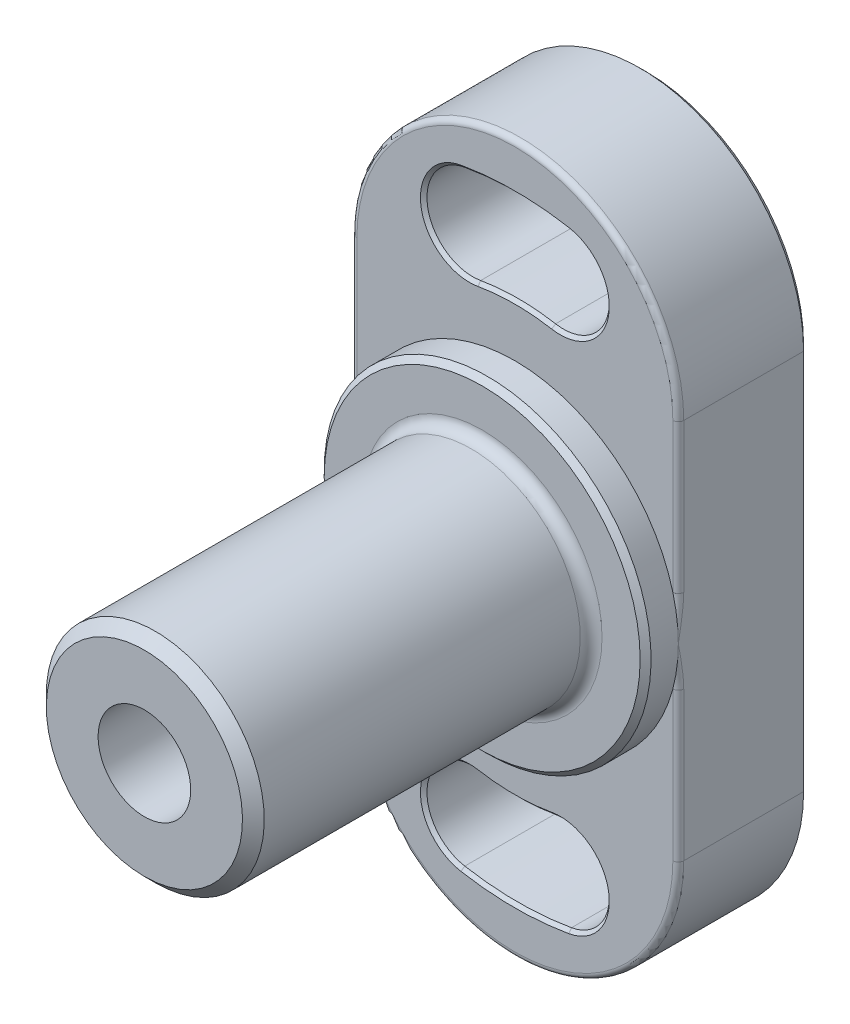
ISO-10303-21;
HEADER;
FILE_DESCRIPTION(('STEP AP214'),'2;1');
FILE_NAME('part.step','',(''),(''),'','','');
FILE_SCHEMA(('AUTOMOTIVE_DESIGN { 1 0 10303 214 1 1 1 1 }'));
ENDSEC;
DATA;
#1=APPLICATION_CONTEXT('core data for automotive mechanical design processes');
#2=APPLICATION_PROTOCOL_DEFINITION('international standard','automotive_design',2000,#1);
#3=PRODUCT_CONTEXT('',#1,'mechanical');
#4=PRODUCT('Part','Part','',(#3));
#5=PRODUCT_RELATED_PRODUCT_CATEGORY('part','',(#4));
#6=PRODUCT_DEFINITION_FORMATION('','',#4);
#7=PRODUCT_DEFINITION_CONTEXT('part definition',#1,'design');
#8=PRODUCT_DEFINITION('design','',#6,#7);
#9=PRODUCT_DEFINITION_SHAPE('','',#8);
#10=(LENGTH_UNIT() NAMED_UNIT(*) SI_UNIT(.MILLI.,.METRE.));
#11=(NAMED_UNIT(*) PLANE_ANGLE_UNIT() SI_UNIT($,.RADIAN.));
#12=(NAMED_UNIT(*) SI_UNIT($,.STERADIAN.) SOLID_ANGLE_UNIT());
#13=UNCERTAINTY_MEASURE_WITH_UNIT(LENGTH_MEASURE(1.E-05),#10,'distance_accuracy_value','');
#14=(GEOMETRIC_REPRESENTATION_CONTEXT(3) GLOBAL_UNCERTAINTY_ASSIGNED_CONTEXT((#13)) GLOBAL_UNIT_ASSIGNED_CONTEXT((#10,
#11,#12)) REPRESENTATION_CONTEXT('',''));
#15=CARTESIAN_POINT('',(0.,0.,0.));
#16=DIRECTION('',(0.,0.,1.));
#17=DIRECTION('',(1.,0.,0.));
#18=AXIS2_PLACEMENT_3D('',#15,#16,#17);
#19=CARTESIAN_POINT('',(0.,0.,0.));
#20=DIRECTION('',(0.,0.,-1.));
#21=DIRECTION('',(0.,1.,0.));
#22=AXIS2_PLACEMENT_3D('',#19,#20,#21);
#23=CYLINDRICAL_SURFACE('',#22,4.25);
#24=CARTESIAN_POINT('',(0.,0.,46.));
#25=DIRECTION('',(0.,0.,-1.));
#26=DIRECTION('',(0.,1.,0.));
#27=AXIS2_PLACEMENT_3D('',#24,#25,#26);
#28=CIRCLE('',#27,4.25);
#29=CARTESIAN_POINT('',(0.,4.25,46.));
#30=VERTEX_POINT('',#29);
#31=EDGE_CURVE('E235',#30,#30,#28,.T.);
#32=ORIENTED_EDGE('',*,*,#31,.F.);
#33=EDGE_LOOP('',(#32));
#34=FACE_BOUND('',#33,.T.);
#35=CARTESIAN_POINT('',(0.,0.,11.));
#36=DIRECTION('',(0.,0.,-1.));
#37=DIRECTION('',(0.,1.,0.));
#38=AXIS2_PLACEMENT_3D('',#35,#36,#37);
#39=CIRCLE('',#38,4.25);
#40=CARTESIAN_POINT('',(0.,4.25,11.));
#41=VERTEX_POINT('',#40);
#42=EDGE_CURVE('E9',#41,#41,#39,.F.);
#43=ORIENTED_EDGE('',*,*,#42,.F.);
#44=EDGE_LOOP('',(#43));
#45=FACE_BOUND('',#44,.T.);
#46=ADVANCED_FACE('F14',(#34,#45),#23,.F.);
#47=CARTESIAN_POINT('',(0.,17.5,12.));
#48=DIRECTION('',(0.,0.,1.));
#49=DIRECTION('',(0.,-1.,0.));
#50=AXIS2_PLACEMENT_3D('',#47,#48,#49);
#51=PLANE('',#50);
#52=CARTESIAN_POINT('',(-4.16755626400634,23.635386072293,12.));
#53=DIRECTION('',(0.,0.,1.));
#54=DIRECTION('',(0.,-1.,0.));
#55=AXIS2_PLACEMENT_3D('',#52,#53,#54);
#56=CIRCLE('',#55,4.5);
#57=CARTESIAN_POINT('',(-3.38613946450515,19.203751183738,12.));
#58=VERTEX_POINT('',#57);
#59=CARTESIAN_POINT('',(-4.94897306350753,28.067020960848,12.));
#60=VERTEX_POINT('',#59);
#61=EDGE_CURVE('E1100',#58,#60,#56,.F.);
#62=ORIENTED_EDGE('',*,*,#61,.T.);
#63=CARTESIAN_POINT('',(0.,0.,12.));
#64=DIRECTION('',(0.,0.,1.));
#65=DIRECTION('',(0.,-1.,0.));
#66=AXIS2_PLACEMENT_3D('',#63,#64,#65);
#67=CIRCLE('',#66,28.5);
#68=CARTESIAN_POINT('',(4.94897306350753,28.067020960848,12.));
#69=VERTEX_POINT('',#68);
#70=EDGE_CURVE('E1102',#60,#69,#67,.F.);
#71=ORIENTED_EDGE('',*,*,#70,.T.);
#72=CARTESIAN_POINT('',(4.16755626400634,23.635386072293,12.));
#73=DIRECTION('',(0.,0.,1.));
#74=DIRECTION('',(0.,-1.,0.));
#75=AXIS2_PLACEMENT_3D('',#72,#73,#74);
#76=CIRCLE('',#75,4.5);
#77=CARTESIAN_POINT('',(3.38613946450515,19.203751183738,12.));
#78=VERTEX_POINT('',#77);
#79=EDGE_CURVE('E1098',#69,#78,#76,.F.);
#80=ORIENTED_EDGE('',*,*,#79,.T.);
#81=CARTESIAN_POINT('',(0.,0.,12.));
#82=DIRECTION('',(0.,0.,1.));
#83=DIRECTION('',(0.,-1.,0.));
#84=AXIS2_PLACEMENT_3D('',#81,#82,#83);
#85=CIRCLE('',#84,19.5);
#86=EDGE_CURVE('E1096',#78,#58,#85,.T.);
#87=ORIENTED_EDGE('',*,*,#86,.T.);
#88=EDGE_LOOP('',(#62,#71,#80,#87));
#89=FACE_BOUND('',#88,.T.);
#90=CARTESIAN_POINT('',(0.,0.,12.));
#91=DIRECTION('',(0.,0.,-1.));
#92=DIRECTION('',(0.,1.,0.));
#93=AXIS2_PLACEMENT_3D('',#90,#91,#92);
#94=CIRCLE('',#93,15.);
#95=CARTESIAN_POINT('',(-14.5,3.84057287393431,12.));
#96=VERTEX_POINT('',#95);
#97=CARTESIAN_POINT('',(14.5,3.84057287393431,12.));
#98=VERTEX_POINT('',#97);
#99=EDGE_CURVE('E242',#96,#98,#94,.T.);
#100=ORIENTED_EDGE('',*,*,#99,.T.);
#101=DIRECTION('',(0.,1.,0.));
#102=VECTOR('',#101,1.);
#103=CARTESIAN_POINT('',(14.5,17.5,12.));
#104=LINE('',#103,#102);
#105=CARTESIAN_POINT('',(14.5,17.5,12.));
#106=VERTEX_POINT('',#105);
#107=EDGE_CURVE('E248',#98,#106,#104,.T.);
#108=ORIENTED_EDGE('',*,*,#107,.T.);
#109=CARTESIAN_POINT('',(0.,17.5,12.));
#110=DIRECTION('',(0.,0.,1.));
#111=DIRECTION('',(0.,-1.,0.));
#112=AXIS2_PLACEMENT_3D('',#109,#110,#111);
#113=CIRCLE('',#112,14.5);
#114=CARTESIAN_POINT('',(-14.5,17.5,12.));
#115=VERTEX_POINT('',#114);
#116=EDGE_CURVE('E574',#106,#115,#113,.T.);
#117=ORIENTED_EDGE('',*,*,#116,.T.);
#118=DIRECTION('',(0.,-1.,0.));
#119=VECTOR('',#118,1.);
#120=CARTESIAN_POINT('',(-14.5,0.,12.));
#121=LINE('',#120,#119);
#122=EDGE_CURVE('E566',#115,#96,#121,.T.);
#123=ORIENTED_EDGE('',*,*,#122,.T.);
#124=EDGE_LOOP('',(#100,#108,#117,#123));
#125=FACE_BOUND('',#124,.T.);
#126=ADVANCED_FACE('F431',(#89,#125),#51,.T.);
#127=CARTESIAN_POINT('',(4.16755626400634,-23.635386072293,12.));
#128=DIRECTION('',(0.,0.,1.));
#129=DIRECTION('',(0.,-1.,0.));
#130=AXIS2_PLACEMENT_3D('',#127,#128,#129);
#131=CIRCLE('',#130,4.5);
#132=CARTESIAN_POINT('',(3.38613946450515,-19.203751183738,12.));
#133=VERTEX_POINT('',#132);
#134=CARTESIAN_POINT('',(4.94897306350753,-28.067020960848,12.));
#135=VERTEX_POINT('',#134);
#136=EDGE_CURVE('E1126',#133,#135,#131,.F.);
#137=ORIENTED_EDGE('',*,*,#136,.T.);
#138=CARTESIAN_POINT('',(0.,0.,12.));
#139=DIRECTION('',(0.,0.,1.));
#140=DIRECTION('',(0.,-1.,0.));
#141=AXIS2_PLACEMENT_3D('',#138,#139,#140);
#142=CIRCLE('',#141,28.5);
#143=CARTESIAN_POINT('',(-4.94897306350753,-28.067020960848,12.));
#144=VERTEX_POINT('',#143);
#145=EDGE_CURVE('E1128',#135,#144,#142,.F.);
#146=ORIENTED_EDGE('',*,*,#145,.T.);
#147=CARTESIAN_POINT('',(-4.16755626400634,-23.635386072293,12.));
#148=DIRECTION('',(0.,0.,1.));
#149=DIRECTION('',(0.,-1.,0.));
#150=AXIS2_PLACEMENT_3D('',#147,#148,#149);
#151=CIRCLE('',#150,4.5);
#152=CARTESIAN_POINT('',(-3.38613946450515,-19.203751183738,12.));
#153=VERTEX_POINT('',#152);
#154=EDGE_CURVE('E1124',#144,#153,#151,.F.);
#155=ORIENTED_EDGE('',*,*,#154,.T.);
#156=CARTESIAN_POINT('',(0.,0.,12.));
#157=DIRECTION('',(0.,0.,1.));
#158=DIRECTION('',(0.,-1.,0.));
#159=AXIS2_PLACEMENT_3D('',#156,#157,#158);
#160=CIRCLE('',#159,19.5);
#161=EDGE_CURVE('E1122',#153,#133,#160,.T.);
#162=ORIENTED_EDGE('',*,*,#161,.T.);
#163=EDGE_LOOP('',(#137,#146,#155,#162));
#164=FACE_BOUND('',#163,.T.);
#165=CARTESIAN_POINT('',(0.,-17.5,12.));
#166=DIRECTION('',(0.,0.,1.));
#167=DIRECTION('',(0.,-1.,0.));
#168=AXIS2_PLACEMENT_3D('',#165,#166,#167);
#169=CIRCLE('',#168,14.5);
#170=CARTESIAN_POINT('',(-14.5,-17.5,12.));
#171=VERTEX_POINT('',#170);
#172=CARTESIAN_POINT('',(14.5,-17.5,12.));
#173=VERTEX_POINT('',#172);
#174=EDGE_CURVE('E606',#171,#173,#169,.T.);
#175=ORIENTED_EDGE('',*,*,#174,.T.);
#176=DIRECTION('',(0.,1.,0.));
#177=VECTOR('',#176,1.);
#178=CARTESIAN_POINT('',(14.5,0.,12.));
#179=LINE('',#178,#177);
#180=CARTESIAN_POINT('',(14.5,-3.8405728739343,12.));
#181=VERTEX_POINT('',#180);
#182=EDGE_CURVE('E604',#173,#181,#179,.T.);
#183=ORIENTED_EDGE('',*,*,#182,.T.);
#184=CARTESIAN_POINT('',(-14.5,-3.84057287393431,12.));
#185=VERTEX_POINT('',#184);
#186=EDGE_CURVE('E231',#181,#185,#94,.T.);
#187=ORIENTED_EDGE('',*,*,#186,.T.);
#188=DIRECTION('',(0.,-1.,0.));
#189=VECTOR('',#188,1.);
#190=CARTESIAN_POINT('',(-14.5,-17.5,12.));
#191=LINE('',#190,#189);
#192=EDGE_CURVE('E608',#185,#171,#191,.T.);
#193=ORIENTED_EDGE('',*,*,#192,.T.);
#194=EDGE_LOOP('',(#175,#183,#187,#193));
#195=FACE_BOUND('',#194,.T.);
#196=ADVANCED_FACE('F437',(#164,#195),#51,.T.);
#197=CARTESIAN_POINT('',(0.,17.5,0.));
#198=DIRECTION('',(0.,0.,1.));
#199=DIRECTION('',(0.,-1.,0.));
#200=AXIS2_PLACEMENT_3D('',#197,#198,#199);
#201=PLANE('',#200);
#202=CARTESIAN_POINT('',(4.16755626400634,23.635386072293,0.));
#203=DIRECTION('',(0.,0.,1.));
#204=DIRECTION('',(0.,-1.,0.));
#205=AXIS2_PLACEMENT_3D('',#202,#203,#204);
#206=CIRCLE('',#205,4.5);
#207=CARTESIAN_POINT('',(3.38613946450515,19.203751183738,0.));
#208=VERTEX_POINT('',#207);
#209=CARTESIAN_POINT('',(4.94897306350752,28.067020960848,0.));
#210=VERTEX_POINT('',#209);
#211=EDGE_CURVE('E37',#208,#210,#206,.T.);
#212=ORIENTED_EDGE('',*,*,#211,.T.);
#213=CARTESIAN_POINT('',(0.,0.,0.));
#214=DIRECTION('',(0.,0.,1.));
#215=DIRECTION('',(0.,-1.,0.));
#216=AXIS2_PLACEMENT_3D('',#213,#214,#215);
#217=CIRCLE('',#216,28.5);
#218=CARTESIAN_POINT('',(-4.94897306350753,28.067020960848,0.));
#219=VERTEX_POINT('',#218);
#220=EDGE_CURVE('E702',#210,#219,#217,.T.);
#221=ORIENTED_EDGE('',*,*,#220,.T.);
#222=CARTESIAN_POINT('',(-4.16755626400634,23.635386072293,0.));
#223=DIRECTION('',(0.,0.,1.));
#224=DIRECTION('',(0.,-1.,0.));
#225=AXIS2_PLACEMENT_3D('',#222,#223,#224);
#226=CIRCLE('',#225,4.5);
#227=CARTESIAN_POINT('',(-3.38613946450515,19.203751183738,0.));
#228=VERTEX_POINT('',#227);
#229=EDGE_CURVE('E675',#219,#228,#226,.T.);
#230=ORIENTED_EDGE('',*,*,#229,.T.);
#231=CARTESIAN_POINT('',(0.,0.,0.));
#232=DIRECTION('',(0.,0.,1.));
#233=DIRECTION('',(0.,-1.,0.));
#234=AXIS2_PLACEMENT_3D('',#231,#232,#233);
#235=CIRCLE('',#234,19.5);
#236=EDGE_CURVE('E1150',#228,#208,#235,.F.);
#237=ORIENTED_EDGE('',*,*,#236,.T.);
#238=EDGE_LOOP('',(#212,#221,#230,#237));
#239=FACE_BOUND('',#238,.T.);
#240=CARTESIAN_POINT('',(-4.16755626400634,-23.635386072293,0.));
#241=DIRECTION('',(0.,0.,1.));
#242=DIRECTION('',(0.,-1.,0.));
#243=AXIS2_PLACEMENT_3D('',#240,#241,#242);
#244=CIRCLE('',#243,4.5);
#245=CARTESIAN_POINT('',(-3.38613946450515,-19.203751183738,0.));
#246=VERTEX_POINT('',#245);
#247=CARTESIAN_POINT('',(-4.94897306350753,-28.067020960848,0.));
#248=VERTEX_POINT('',#247);
#249=EDGE_CURVE('E1062',#246,#248,#244,.T.);
#250=ORIENTED_EDGE('',*,*,#249,.T.);
#251=CARTESIAN_POINT('',(0.,0.,0.));
#252=DIRECTION('',(0.,0.,1.));
#253=DIRECTION('',(0.,-1.,0.));
#254=AXIS2_PLACEMENT_3D('',#251,#252,#253);
#255=CIRCLE('',#254,28.5);
#256=CARTESIAN_POINT('',(4.94897306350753,-28.067020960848,0.));
#257=VERTEX_POINT('',#256);
#258=EDGE_CURVE('E1148',#248,#257,#255,.T.);
#259=ORIENTED_EDGE('',*,*,#258,.T.);
#260=CARTESIAN_POINT('',(4.16755626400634,-23.635386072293,0.));
#261=DIRECTION('',(0.,0.,1.));
#262=DIRECTION('',(0.,-1.,0.));
#263=AXIS2_PLACEMENT_3D('',#260,#261,#262);
#264=CIRCLE('',#263,4.5);
#265=CARTESIAN_POINT('',(3.38613946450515,-19.203751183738,0.));
#266=VERTEX_POINT('',#265);
#267=EDGE_CURVE('E1146',#257,#266,#264,.T.);
#268=ORIENTED_EDGE('',*,*,#267,.T.);
#269=CARTESIAN_POINT('',(0.,0.,0.));
#270=DIRECTION('',(0.,0.,1.));
#271=DIRECTION('',(0.,-1.,0.));
#272=AXIS2_PLACEMENT_3D('',#269,#270,#271);
#273=CIRCLE('',#272,19.5);
#274=EDGE_CURVE('E1143',#266,#246,#273,.F.);
#275=ORIENTED_EDGE('',*,*,#274,.T.);
#276=EDGE_LOOP('',(#250,#259,#268,#275));
#277=FACE_BOUND('',#276,.T.);
#278=CARTESIAN_POINT('',(0.,17.5,0.));
#279=DIRECTION('',(0.,0.,1.));
#280=DIRECTION('',(0.,-1.,0.));
#281=AXIS2_PLACEMENT_3D('',#278,#279,#280);
#282=CIRCLE('',#281,14.5);
#283=CARTESIAN_POINT('',(-14.5,17.5,0.));
#284=VERTEX_POINT('',#283);
#285=CARTESIAN_POINT('',(14.5,17.5,0.));
#286=VERTEX_POINT('',#285);
#287=EDGE_CURVE('E1066',#284,#286,#282,.F.);
#288=ORIENTED_EDGE('',*,*,#287,.T.);
#289=DIRECTION('',(0.,-1.,0.));
#290=VECTOR('',#289,1.);
#291=CARTESIAN_POINT('',(14.5,17.5,0.));
#292=LINE('',#291,#290);
#293=CARTESIAN_POINT('',(14.5,-17.5,0.));
#294=VERTEX_POINT('',#293);
#295=EDGE_CURVE('E1068',#286,#294,#292,.T.);
#296=ORIENTED_EDGE('',*,*,#295,.T.);
#297=CARTESIAN_POINT('',(0.,-17.5,0.));
#298=DIRECTION('',(0.,0.,1.));
#299=DIRECTION('',(0.,-1.,0.));
#300=AXIS2_PLACEMENT_3D('',#297,#298,#299);
#301=CIRCLE('',#300,14.5);
#302=CARTESIAN_POINT('',(-14.5,-17.5,0.));
#303=VERTEX_POINT('',#302);
#304=EDGE_CURVE('E1073',#294,#303,#301,.F.);
#305=ORIENTED_EDGE('',*,*,#304,.T.);
#306=DIRECTION('',(0.,1.,0.));
#307=VECTOR('',#306,1.);
#308=CARTESIAN_POINT('',(-14.5,17.5,0.));
#309=LINE('',#308,#307);
#310=EDGE_CURVE('E580',#303,#284,#309,.T.);
#311=ORIENTED_EDGE('',*,*,#310,.T.);
#312=EDGE_LOOP('',(#288,#296,#305,#311));
#313=FACE_BOUND('',#312,.T.);
#314=ADVANCED_FACE('F272',(#239,#277,#313),#201,.F.);
#315=CARTESIAN_POINT('',(0.,17.5,12.));
#316=DIRECTION('',(0.,0.,-1.));
#317=DIRECTION('',(0.,1.,0.));
#318=AXIS2_PLACEMENT_3D('',#315,#316,#317);
#319=CYLINDRICAL_SURFACE('',#318,15.);
#320=DIRECTION('',(0.,0.,-1.));
#321=VECTOR('',#320,1.);
#322=CARTESIAN_POINT('',(15.,17.5,12.));
#323=LINE('',#322,#321);
#324=CARTESIAN_POINT('',(15.,17.5,11.5));
#325=VERTEX_POINT('',#324);
#326=CARTESIAN_POINT('',(15.,17.5,0.499999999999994));
#327=VERTEX_POINT('',#326);
#328=EDGE_CURVE('E618',#325,#327,#323,.T.);
#329=ORIENTED_EDGE('',*,*,#328,.T.);
#330=CARTESIAN_POINT('',(0.,17.5,0.499999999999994));
#331=DIRECTION('',(0.,0.,1.));
#332=DIRECTION('',(0.,-1.,0.));
#333=AXIS2_PLACEMENT_3D('',#330,#331,#332);
#334=CIRCLE('',#333,15.);
#335=CARTESIAN_POINT('',(-15.,17.5,0.499999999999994));
#336=VERTEX_POINT('',#335);
#337=EDGE_CURVE('E1080',#327,#336,#334,.T.);
#338=ORIENTED_EDGE('',*,*,#337,.T.);
#339=DIRECTION('',(0.,0.,-1.));
#340=VECTOR('',#339,1.);
#341=CARTESIAN_POINT('',(-15.,17.5,12.));
#342=LINE('',#341,#340);
#343=CARTESIAN_POINT('',(-15.,17.5,11.5));
#344=VERTEX_POINT('',#343);
#345=EDGE_CURVE('E620',#344,#336,#342,.T.);
#346=ORIENTED_EDGE('',*,*,#345,.F.);
#347=CARTESIAN_POINT('',(0.,17.5,11.5));
#348=DIRECTION('',(0.,0.,1.));
#349=DIRECTION('',(0.,-1.,0.));
#350=AXIS2_PLACEMENT_3D('',#347,#348,#349);
#351=CIRCLE('',#350,15.);
#352=EDGE_CURVE('E534',#344,#325,#351,.F.);
#353=ORIENTED_EDGE('',*,*,#352,.T.);
#354=EDGE_LOOP('',(#329,#338,#346,#353));
#355=FACE_BOUND('',#354,.T.);
#356=ADVANCED_FACE('F956',(#355),#319,.T.);
#357=CARTESIAN_POINT('',(-15.,17.5,12.));
#358=DIRECTION('',(1.,0.,0.));
#359=DIRECTION('',(0.,1.,0.));
#360=AXIS2_PLACEMENT_3D('',#357,#358,#359);
#361=PLANE('',#360);
#362=ORIENTED_EDGE('',*,*,#345,.T.);
#363=DIRECTION('',(0.,-1.,0.));
#364=VECTOR('',#363,1.);
#365=CARTESIAN_POINT('',(-15.,17.5,0.499999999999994));
#366=LINE('',#365,#364);
#367=CARTESIAN_POINT('',(-15.,-17.5,0.499999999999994));
#368=VERTEX_POINT('',#367);
#369=EDGE_CURVE('E670',#336,#368,#366,.T.);
#370=ORIENTED_EDGE('',*,*,#369,.T.);
#371=DIRECTION('',(0.,0.,-1.));
#372=VECTOR('',#371,1.);
#373=CARTESIAN_POINT('',(-15.,-17.5,12.));
#374=LINE('',#373,#372);
#375=CARTESIAN_POINT('',(-15.,-17.5,11.5));
#376=VERTEX_POINT('',#375);
#377=EDGE_CURVE('E617',#376,#368,#374,.T.);
#378=ORIENTED_EDGE('',*,*,#377,.F.);
#379=DIRECTION('',(0.,-1.,0.));
#380=VECTOR('',#379,1.);
#381=CARTESIAN_POINT('',(-15.,0.,11.5));
#382=LINE('',#381,#380);
#383=CARTESIAN_POINT('',(-15.,-3.84057287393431,11.5));
#384=VERTEX_POINT('',#383);
#385=EDGE_CURVE('E578',#376,#384,#382,.F.);
#386=ORIENTED_EDGE('',*,*,#385,.T.);
#387=CARTESIAN_POINT('',(-14.1856737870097,-4.87510607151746,12.));
#388=CARTESIAN_POINT('',(-14.4308988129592,-4.82003658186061,12.1904278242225));
#389=CARTESIAN_POINT('',(-14.7154494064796,-4.8577830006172,12.0599024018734));
#390=CARTESIAN_POINT('',(-15.,-4.89552941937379,11.9293769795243));
#391=CARTESIAN_POINT('',(-15.,-4.98312868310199,11.6264626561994));
#392=CARTESIAN_POINT('',(-14.1999027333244,-4.83370691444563,12.));
#393=CARTESIAN_POINT('',(-14.4472952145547,-4.78697960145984,12.1792968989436));
#394=CARTESIAN_POINT('',(-14.7236897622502,-4.82202753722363,12.0454610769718));
#395=CARTESIAN_POINT('',(-15.,-4.85749879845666,11.911776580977));
#396=CARTESIAN_POINT('',(-15.,-4.93581260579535,11.6128365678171));
#397=CARTESIAN_POINT('',(-14.2141201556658,-4.79174292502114,12.));
#398=CARTESIAN_POINT('',(-14.4628891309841,-4.75158482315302,12.1683482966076));
#399=CARTESIAN_POINT('',(-14.731480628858,-4.78429589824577,12.0318535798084));
#400=CARTESIAN_POINT('',(-15.,-4.81740548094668,11.8954843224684));
#401=CARTESIAN_POINT('',(-15.,-4.88806808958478,11.6008401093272));
#402=CARTESIAN_POINT('',(-14.2424242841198,-4.70694533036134,12.));
#403=CARTESIAN_POINT('',(-14.4925191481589,-4.67765986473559,12.1471868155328));
#404=CARTESIAN_POINT('',(-14.746297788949,-4.70595521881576,12.006266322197));
#405=CARTESIAN_POINT('',(-15.,-4.73463769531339,11.8654769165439));
#406=CARTESIAN_POINT('',(-15.,-4.79202360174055,11.5795570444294));
#407=CARTESIAN_POINT('',(-14.2565111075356,-4.66411264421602,12.));
#408=CARTESIAN_POINT('',(-14.5065891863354,-4.6391216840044,12.136953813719));
#409=CARTESIAN_POINT('',(-14.7533248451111,-4.66534911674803,11.9942849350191));
#410=CARTESIAN_POINT('',(-15.,-4.69194412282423,11.8517164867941));
#411=CARTESIAN_POINT('',(-15.,-4.7437242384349,11.57026771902));
#412=CARTESIAN_POINT('',(-14.2844323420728,-4.57788643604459,12.));
#413=CARTESIAN_POINT('',(-14.5334302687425,-4.56006692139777,12.1174390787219));
#414=CARTESIAN_POINT('',(-14.7667441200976,-4.58238623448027,11.9719156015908));
#415=CARTESIAN_POINT('',(-15.,-4.60507035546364,11.8264891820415));
#416=CARTESIAN_POINT('',(-15.,-4.64692445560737,11.5538496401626));
#417=CARTESIAN_POINT('',(-14.2982673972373,-4.53449504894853,12.));
#418=CARTESIAN_POINT('',(-14.5462279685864,-4.51954018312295,12.1081378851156));
#419=CARTESIAN_POINT('',(-14.7731382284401,-4.54003523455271,11.9615228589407));
#420=CARTESIAN_POINT('',(-15.,-4.56087090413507,11.8149846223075));
#421=CARTESIAN_POINT('',(-15.,-4.59842511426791,11.5467143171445));
#422=CARTESIAN_POINT('',(-14.3256841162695,-4.44711949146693,12.));
#423=CARTESIAN_POINT('',(-14.5707712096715,-4.4369136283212,12.0904385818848));
#424=CARTESIAN_POINT('',(-14.785409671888,-4.45394787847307,11.9421401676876));
#425=CARTESIAN_POINT('',(-15.,-4.47131934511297,11.7939175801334));
#426=CARTESIAN_POINT('',(-15.,-4.501185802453,11.5342294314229));
#427=CARTESIAN_POINT('',(-14.3392657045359,-4.40313515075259,12.));
#428=CARTESIAN_POINT('',(-14.5825339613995,-4.39479436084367,12.0820269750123));
#429=CARTESIAN_POINT('',(-14.7912868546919,-4.41021111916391,11.9331506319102));
#430=CARTESIAN_POINT('',(-15.,-4.42594200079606,11.7843325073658));
#431=CARTESIAN_POINT('',(-15.,-4.45244576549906,11.528880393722));
#432=CARTESIAN_POINT('',(-14.379325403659,-4.27122821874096,12.));
#433=CARTESIAN_POINT('',(-14.6161467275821,-4.26789348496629,12.0583366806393));
#434=CARTESIAN_POINT('',(-14.808152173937,-4.27829233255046,11.9082386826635));
#435=CARTESIAN_POINT('',(-15.,-4.28991775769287,11.7583744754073));
#436=CARTESIAN_POINT('',(-15.,-4.30689436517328,11.5151876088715));
#437=CARTESIAN_POINT('',(-14.4053721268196,-4.18256948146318,12.));
#438=CARTESIAN_POINT('',(-14.6368699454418,-4.18084594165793,12.0441973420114));
#439=CARTESIAN_POINT('',(-14.8184923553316,-4.18863761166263,11.8941760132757));
#440=CARTESIAN_POINT('',(-15.,-4.19749690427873,11.7442986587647));
#441=CARTESIAN_POINT('',(-15.,-4.20987372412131,11.509060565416));
#442=CARTESIAN_POINT('',(-14.4561333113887,-4.00360812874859,12.));
#443=CARTESIAN_POINT('',(-14.6755394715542,-4.00386221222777,12.0189870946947));
#444=CARTESIAN_POINT('',(-14.8378251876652,-4.00689595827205,11.8701311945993));
#445=CARTESIAN_POINT('',(-15.,-4.01098340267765,11.7214120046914));
#446=CARTESIAN_POINT('',(-15.,-4.01558600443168,11.5013556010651));
#447=CARTESIAN_POINT('',(-14.4808464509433,-3.91330399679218,12.));
#448=CARTESIAN_POINT('',(-14.693550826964,-3.91379350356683,12.007860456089));
#449=CARTESIAN_POINT('',(-14.8468165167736,-3.91480674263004,11.8601530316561));
#450=CARTESIAN_POINT('',(-15.,-3.91673656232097,11.7125243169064));
#451=CARTESIAN_POINT('',(-15.,-3.91831877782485,11.4997821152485));
#452=CARTESIAN_POINT('',(-14.5440442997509,-3.67347958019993,12.));
#453=CARTESIAN_POINT('',(-14.7378916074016,-3.67459584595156,11.9821196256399));
#454=CARTESIAN_POINT('',(-14.8690574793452,-3.67002882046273,11.8383146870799));
#455=CARTESIAN_POINT('',(-15.,-3.66790082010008,11.6947323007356));
#456=CARTESIAN_POINT('',(-15.,-3.66192628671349,11.5004219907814));
#457=CARTESIAN_POINT('',(-14.5812893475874,-3.52283182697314,12.));
#458=CARTESIAN_POINT('',(-14.7626122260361,-3.52272499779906,11.9695190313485));
#459=CARTESIAN_POINT('',(-14.8813776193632,-3.51605500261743,11.8292949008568));
#460=CARTESIAN_POINT('',(-15.,-3.51134329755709,11.6891467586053));
#461=CARTESIAN_POINT('',(-15.,-3.5028105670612,11.5056809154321));
#462=CARTESIAN_POINT('',(-14.6514491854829,-3.21860703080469,12.));
#463=CARTESIAN_POINT('',(-14.8072920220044,-3.21617499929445,11.9499722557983));
#464=CARTESIAN_POINT('',(-14.9037142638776,-3.20589367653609,11.8180832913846));
#465=CARTESIAN_POINT('',(-15.,-3.19753505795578,11.6862586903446));
#466=CARTESIAN_POINT('',(-15.,-3.18495584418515,11.5232619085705));
#467=CARTESIAN_POINT('',(-14.6843623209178,-3.06502889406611,12.));
#468=CARTESIAN_POINT('',(-14.8273706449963,-3.06110184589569,11.9429309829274));
#469=CARTESIAN_POINT('',(-14.9137298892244,-3.04970534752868,11.8158940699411));
#470=CARTESIAN_POINT('',(-15.,-3.03985484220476,11.6888527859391));
#471=CARTESIAN_POINT('',(-15.,-3.02621700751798,11.5355866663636));
#472=CARTESIAN_POINT('',(-14.7456026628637,-2.75538011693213,12.));
#473=CARTESIAN_POINT('',(-14.8635844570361,-2.74912309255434,11.9332924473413));
#474=CARTESIAN_POINT('',(-14.9318364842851,-2.73595159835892,11.8167708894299));
#475=CARTESIAN_POINT('',(-15.,-2.72431238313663,11.7002450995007));
#476=CARTESIAN_POINT('',(-15.,-2.70915717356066,11.5655812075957));
#477=CARTESIAN_POINT('',(-14.7739270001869,-2.59930798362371,12.));
#478=CARTESIAN_POINT('',(-14.8797958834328,-2.59188688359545,11.9306439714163));
#479=CARTESIAN_POINT('',(-14.939926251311,-2.57838538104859,11.819840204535));
#480=CARTESIAN_POINT('',(-15.,-2.56610052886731,11.7089994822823));
#481=CARTESIAN_POINT('',(-15.,-2.55083649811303,11.5832543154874));
#482=CARTESIAN_POINT('',(-14.8257645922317,-2.28518355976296,12.));
#483=CARTESIAN_POINT('',(-14.9087752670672,-2.27629701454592,11.9288211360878));
#484=CARTESIAN_POINT('',(-14.9544147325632,-2.26247177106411,11.8300229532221));
#485=CARTESIAN_POINT('',(-15.,-2.24984605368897,11.7311838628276));
#486=CARTESIAN_POINT('',(-15.,-2.23469494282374,11.6226569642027));
#487=CARTESIAN_POINT('',(-14.8492773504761,-2.12713106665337,12.));
#488=CARTESIAN_POINT('',(-14.9215959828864,-2.11765812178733,11.9296190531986));
#489=CARTESIAN_POINT('',(-14.9608132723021,-2.10412429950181,11.8371368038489));
#490=CARTESIAN_POINT('',(-15.,-2.09150794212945,11.7445994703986));
#491=CARTESIAN_POINT('',(-15.,-2.07687411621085,11.6443869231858));
#492=CARTESIAN_POINT('',(-14.9126243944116,-1.64850858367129,12.));
#493=CARTESIAN_POINT('',(-14.9554554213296,-1.64005426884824,11.9359836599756));
#494=CARTESIAN_POINT('',(-14.9777963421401,-1.62629223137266,11.863133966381));
#495=CARTESIAN_POINT('',(-15.,-1.61627727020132,11.7900907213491));
#496=CARTESIAN_POINT('',(-15.,-1.60199575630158,11.7143989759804));
#497=CARTESIAN_POINT('',(-14.944855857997,-1.32553957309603,12.));
#498=CARTESIAN_POINT('',(-14.9720715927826,-1.31713375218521,11.9455352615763));
#499=CARTESIAN_POINT('',(-14.9860529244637,-1.3061101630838,11.8866390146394));
#500=CARTESIAN_POINT('',(-15.,-1.29690527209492,11.8276060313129));
#501=CARTESIAN_POINT('',(-15.,-1.28562567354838,11.7672750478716));
#502=CARTESIAN_POINT('',(-14.9882629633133,-0.676558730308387,12.));
#503=CARTESIAN_POINT('',(-14.9941421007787,-0.671823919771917,11.9696596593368));
#504=CARTESIAN_POINT('',(-14.9970846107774,-0.665317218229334,11.93934272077));
#505=CARTESIAN_POINT('',(-15.,-0.660555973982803,11.9088694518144));
#506=CARTESIAN_POINT('',(-15.,-0.654060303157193,11.8786148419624));
#507=CARTESIAN_POINT('',(-14.9994473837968,-0.350548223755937,12.));
#508=CARTESIAN_POINT('',(-14.9997238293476,-0.347649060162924,11.9842692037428));
#509=CARTESIAN_POINT('',(-14.9998620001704,-0.344706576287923,11.9685389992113));
#510=CARTESIAN_POINT('',(-15.,-0.341806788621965,11.9528049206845));
#511=CARTESIAN_POINT('',(-15.,-0.338864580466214,11.9370762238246));
#512=CARTESIAN_POINT('',(-14.9999866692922,-0.0204121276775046,12.));
#513=CARTESIAN_POINT('',(-14.99999333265,-0.0202420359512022,11.9990839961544));
#514=CARTESIAN_POINT('',(-14.9999966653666,-0.0200719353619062,11.9981679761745));
#515=CARTESIAN_POINT('',(-15.,-0.0199018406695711,11.9972519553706));
#516=CARTESIAN_POINT('',(-15.,-0.0197317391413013,11.9963359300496));
#517=CARTESIAN_POINT('',(-14.9999916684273,-0.0163293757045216,12.));
#518=CARTESIAN_POINT('',(-14.9999958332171,-0.0161933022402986,11.9992672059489));
#519=CARTESIAN_POINT('',(-14.9999979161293,-0.016057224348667,11.9985344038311));
#520=CARTESIAN_POINT('',(-15.,-0.0159211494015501,11.9978016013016));
#521=CARTESIAN_POINT('',(-15.,-0.0157850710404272,11.9970687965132));
#522=CARTESIAN_POINT('',(-14.9999983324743,-0.00816441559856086,12.));
#523=CARTESIAN_POINT('',(-14.9999991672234,-0.00809638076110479,11.9996336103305));
#524=CARTESIAN_POINT('',(-14.9999995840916,-0.00802834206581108,11.9992672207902));
#525=CARTESIAN_POINT('',(-15.,-0.00796030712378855,11.9989008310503));
#526=CARTESIAN_POINT('',(-15.,-0.00789226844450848,11.9985344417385));
#527=CARTESIAN_POINT('',(-14.9999999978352,-0.00408220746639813,12.));
#528=CARTESIAN_POINT('',(-15.0000000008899,-0.00404818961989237,11.9998168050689));
#529=CARTESIAN_POINT('',(-15.0000000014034,-0.00401417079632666,11.9996336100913));
#530=CARTESIAN_POINT('',(-15.,-0.00398015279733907,11.9994504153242));
#531=CARTESIAN_POINT('',(-15.,-0.00394613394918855,11.9992672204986));
#532=CARTESIAN_POINT('',(-15.,0.,12.));
#533=CARTESIAN_POINT('',(-15.,0.,12.));
#534=CARTESIAN_POINT('',(-15.,0.,12.));
#535=CARTESIAN_POINT('',(-15.,0.,12.));
#536=CARTESIAN_POINT('',(-15.,0.,12.));
#537=(BOUNDED_SURFACE() B_SPLINE_SURFACE(3,2,((#387,#388,#389,#390,#391),(#392,#393,#394,#395,
#396),(#397,#398,#399,#400,#401),(#402,#403,#404,#405,#406),(#407,#408,#409,#410,#411),(#412,
#413,#414,#415,#416),(#417,#418,#419,#420,#421),(#422,#423,#424,#425,#426),(#427,#428,#429,#430,
#431),(#432,#433,#434,#435,#436),(#437,#438,#439,#440,#441),(#442,#443,#444,#445,#446),(#447,
#448,#449,#450,#451),(#452,#453,#454,#455,#456),(#457,#458,#459,#460,#461),(#462,#463,#464,#465,
#466),(#467,#468,#469,#470,#471),(#472,#473,#474,#475,#476),(#477,#478,#479,#480,#481),(#482,
#483,#484,#485,#486),(#487,#488,#489,#490,#491),(#492,#493,#494,#495,#496),(#497,#498,#499,#500,
#501),(#502,#503,#504,#505,#506),(#507,#508,#509,#510,#511),(#512,#513,#514,#515,#516),(#517,
#518,#519,#520,#521),(#522,#523,#524,#525,#526),(#527,#528,#529,#530,#531),(#532,#533,#534,#535,
#536)),.UNSPECIFIED.,.F.,.F.,.F.) B_SPLINE_SURFACE_WITH_KNOTS((4,2,2,2,2,2,2,2,2,2,2,2,2,2,4),
(3,2,3),(0.,0.147631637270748,0.295114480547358,0.442142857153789,0.589214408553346,
0.880696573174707,1.17246254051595,1.64982491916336,2.12736910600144,2.60521073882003,
3.0831016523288,4.04522522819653,5.00694741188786,5.0189898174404,5.03103060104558),(0.,0.5,1.),
.UNSPECIFIED.) GEOMETRIC_REPRESENTATION_ITEM() RATIONAL_B_SPLINE_SURFACE(((1.,0.845842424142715,
1.,0.845842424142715,1.),(1.,0.850711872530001,1.,0.850711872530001,1.),(1.,0.855276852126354,
1.,0.855276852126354,1.),(1.,0.863896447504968,1.,0.863896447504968,1.),(1.,0.867951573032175,
1.,0.867951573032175,1.),(1.,0.875647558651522,1.,0.875647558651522,1.),(1.,0.879289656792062,
1.,0.879289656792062,1.),(1.,0.886240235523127,1.,0.886240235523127,1.),(1.,0.889548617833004,
1.,0.889548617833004,1.),(1.,0.898994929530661,1.,0.898994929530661,1.),(1.,0.90472146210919,1.,
0.90472146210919,1.),(1.,0.915343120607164,1.,0.915343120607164,1.),(1.,0.920237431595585,1.,
0.920237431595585,1.),(1.,0.932262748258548,1.,0.932262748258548,1.),(1.,0.938836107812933,1.,
0.938836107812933,1.),(1.,0.950656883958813,1.,0.950656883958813,1.),(1.,0.955903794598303,1.,
0.955903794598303,1.),(1.,0.965328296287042,1.,0.965328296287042,1.),(1.,0.969505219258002,1.,
0.969505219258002,1.),(1.,0.976948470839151,1.,0.976948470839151,1.),(1.,0.980214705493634,1.,
0.980214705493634,1.),(1.,0.988853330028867,1.,0.988853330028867,1.),(1.,0.993006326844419,1.,
0.993006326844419,1.),(1.,0.998544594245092,1.,0.998544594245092,1.),(1.,0.999931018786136,1.,
0.999931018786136,1.),(1.,0.999998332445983,1.,0.999998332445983,1.),(1.,0.999998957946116,1.,
0.999998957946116,1.),(1.,0.999999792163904,1.,0.999999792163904,1.),(1.,1.00000000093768,1.,
1.00000000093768,1.),(1.,1.,1.,1.,1.))) REPRESENTATION_ITEM('') SURFACE());
#538=CARTESIAN_POINT('',(-15.,-4.98312868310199,11.6264626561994));
#539=CARTESIAN_POINT('',(-15.,-4.93581260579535,11.6128365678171));
#540=CARTESIAN_POINT('',(-15.,-4.88806808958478,11.6008401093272));
#541=CARTESIAN_POINT('',(-15.,-4.79202360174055,11.5795570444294));
#542=CARTESIAN_POINT('',(-15.,-4.7437242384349,11.57026771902));
#543=CARTESIAN_POINT('',(-15.,-4.64692445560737,11.5538496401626));
#544=CARTESIAN_POINT('',(-15.,-4.59842511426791,11.5467143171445));
#545=CARTESIAN_POINT('',(-15.,-4.501185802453,11.5342294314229));
#546=CARTESIAN_POINT('',(-15.,-4.45244576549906,11.528880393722));
#547=CARTESIAN_POINT('',(-15.,-4.30689436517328,11.5151876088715));
#548=CARTESIAN_POINT('',(-15.,-4.20987372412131,11.509060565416));
#549=CARTESIAN_POINT('',(-15.,-4.01558600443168,11.5013556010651));
#550=CARTESIAN_POINT('',(-15.,-3.91831877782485,11.4997821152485));
#551=CARTESIAN_POINT('',(-15.,-3.66192628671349,11.5004219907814));
#552=CARTESIAN_POINT('',(-15.,-3.5028105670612,11.5056809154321));
#553=CARTESIAN_POINT('',(-15.,-3.18495584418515,11.5232619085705));
#554=CARTESIAN_POINT('',(-15.,-3.02621700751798,11.5355866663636));
#555=CARTESIAN_POINT('',(-15.,-2.70915717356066,11.5655812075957));
#556=CARTESIAN_POINT('',(-15.,-2.55083649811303,11.5832543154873));
#557=CARTESIAN_POINT('',(-15.,-2.23469494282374,11.6226569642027));
#558=CARTESIAN_POINT('',(-15.,-2.07687411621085,11.6443869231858));
#559=CARTESIAN_POINT('',(-15.,-1.60199575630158,11.7143989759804));
#560=CARTESIAN_POINT('',(-15.,-1.28562567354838,11.7672750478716));
#561=CARTESIAN_POINT('',(-15.,-0.654060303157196,11.8786148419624));
#562=CARTESIAN_POINT('',(-15.,-0.338864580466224,11.9370762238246));
#563=CARTESIAN_POINT('',(-15.,-0.0197317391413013,11.9963359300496));
#564=CARTESIAN_POINT('',(-15.,-0.0157850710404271,11.9970687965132));
#565=CARTESIAN_POINT('',(-15.,-0.00789226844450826,11.9985344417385));
#566=CARTESIAN_POINT('',(-15.,-0.00394613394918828,11.9992672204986));
#567=CARTESIAN_POINT('',(-15.,0.,12.));
#568=B_SPLINE_CURVE_WITH_KNOTS('',3,(#538,#539,#540,#541,#542,#543,#544,#545,#546,#547,#548,
#549,#550,#551,#552,#553,#554,#555,#556,#557,#558,#559,#560,#561,#562,#563,#564,#565,#566,#567),
.UNSPECIFIED.,.F.,.F.,(4,2,2,2,2,2,2,2,2,2,2,2,2,2,4),(0.,0.147631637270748,0.295114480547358,
0.442142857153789,0.589214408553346,0.880696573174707,1.17246254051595,1.64982491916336,
2.12736910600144,2.60521073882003,3.0831016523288,4.04522522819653,5.00694741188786,
5.0189898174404,5.03103060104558),.UNSPECIFIED.);
#569=CARTESIAN_POINT('',(-15.,0.,12.));
#570=VERTEX_POINT('',#569);
#571=EDGE_CURVE('E581',#384,#570,#568,.T.);
#572=ORIENTED_EDGE('',*,*,#571,.T.);
#573=CARTESIAN_POINT('',(-15.,4.9831286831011,11.6264626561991));
#574=CARTESIAN_POINT('',(-15.,4.89552941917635,11.9293769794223));
#575=CARTESIAN_POINT('',(-14.7154494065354,4.85778300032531,12.0599024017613));
#576=CARTESIAN_POINT('',(-14.4308988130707,4.82003658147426,12.1904278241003));
#577=CARTESIAN_POINT('',(-14.1856737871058,4.87510607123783,12.));
#578=CARTESIAN_POINT('',(-15.,4.93581260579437,11.6128365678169));
#579=CARTESIAN_POINT('',(-15.,4.857498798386,11.9117765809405));
#580=CARTESIAN_POINT('',(-14.7236897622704,4.82202753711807,12.0454610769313));
#581=CARTESIAN_POINT('',(-14.4472952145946,4.78697960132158,12.1792968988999));
#582=CARTESIAN_POINT('',(-14.1999027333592,4.83370691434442,12.));
#583=CARTESIAN_POINT('',(-15.,4.8880680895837,11.6008401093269));
#584=CARTESIAN_POINT('',(-15.,4.81740548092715,11.8954843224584));
#585=CARTESIAN_POINT('',(-14.7314806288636,4.78429589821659,12.0318535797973));
#586=CARTESIAN_POINT('',(-14.462889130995,4.75158482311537,12.1683482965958));
#587=CARTESIAN_POINT('',(-14.2141201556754,4.79174292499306,12.));
#588=CARTESIAN_POINT('',(-15.,4.79202360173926,11.5795570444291));
#589=CARTESIAN_POINT('',(-15.,4.73463769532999,11.8654769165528));
#590=CARTESIAN_POINT('',(-14.7462977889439,4.70595521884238,12.0062663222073));
#591=CARTESIAN_POINT('',(-14.4925191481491,4.67765986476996,12.1471868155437));
#592=CARTESIAN_POINT('',(-14.242424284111,4.70694533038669,12.));
#593=CARTESIAN_POINT('',(-15.,4.74372423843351,11.5702677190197));
#594=CARTESIAN_POINT('',(-15.,4.69194412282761,11.8517164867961));
#595=CARTESIAN_POINT('',(-14.7533248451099,4.66534911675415,11.9942849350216));
#596=CARTESIAN_POINT('',(-14.5065891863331,4.63912168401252,12.1369538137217));
#597=CARTESIAN_POINT('',(-14.2565111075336,4.66411264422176,12.));
#598=CARTESIAN_POINT('',(-15.,4.64692445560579,11.5538496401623));
#599=CARTESIAN_POINT('',(-15.,4.60507035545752,11.8264891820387));
#600=CARTESIAN_POINT('',(-14.7667441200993,4.58238623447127,11.9719156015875));
#601=CARTESIAN_POINT('',(-14.5334302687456,4.56006692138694,12.1174390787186));
#602=CARTESIAN_POINT('',(-14.2844323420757,4.57788643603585,12.));
#603=CARTESIAN_POINT('',(-15.,4.59842511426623,11.5467143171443));
#604=CARTESIAN_POINT('',(-15.,4.56087090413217,11.8149846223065));
#605=CARTESIAN_POINT('',(-14.7731382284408,4.540035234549,11.9615228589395));
#606=CARTESIAN_POINT('',(-14.5462279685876,4.51954018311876,12.1081378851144));
#607=CARTESIAN_POINT('',(-14.2982673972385,4.53449504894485,12.));
#608=CARTESIAN_POINT('',(-15.,4.50118580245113,11.5342294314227));
#609=CARTESIAN_POINT('',(-15.,4.47131934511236,11.7939175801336));
#610=CARTESIAN_POINT('',(-14.7854096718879,4.4539478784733,11.9421401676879));
#611=CARTESIAN_POINT('',(-14.5707712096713,4.43691362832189,12.0904385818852));
#612=CARTESIAN_POINT('',(-14.3256841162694,4.44711949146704,12.));
#613=CARTESIAN_POINT('',(-15.,4.45244576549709,11.5288803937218));
#614=CARTESIAN_POINT('',(-15.,4.42594200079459,11.7843325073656));
#615=CARTESIAN_POINT('',(-14.791286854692,4.41021111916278,11.9331506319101));
#616=CARTESIAN_POINT('',(-14.5825339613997,4.39479436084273,12.0820269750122));
#617=CARTESIAN_POINT('',(-14.3392657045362,4.40313515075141,12.));
#618=CARTESIAN_POINT('',(-15.,4.30689436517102,11.5151876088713));
#619=CARTESIAN_POINT('',(-15.,4.28991775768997,11.7583744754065));
#620=CARTESIAN_POINT('',(-14.8081521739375,4.27829233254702,11.9082386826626));
#621=CARTESIAN_POINT('',(-14.6161467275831,4.26789348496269,12.0583366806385));
#622=CARTESIAN_POINT('',(-14.3793254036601,4.2712282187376,12.));
#623=CARTESIAN_POINT('',(-15.,4.20987372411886,11.5090605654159));
#624=CARTESIAN_POINT('',(-15.,4.19749690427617,11.7442986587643));
#625=CARTESIAN_POINT('',(-14.8184923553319,4.18863761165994,11.8941760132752));
#626=CARTESIAN_POINT('',(-14.6368699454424,4.18084594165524,12.0441973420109));
#627=CARTESIAN_POINT('',(-14.4053721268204,4.18256948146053,12.));
#628=CARTESIAN_POINT('',(-15.,4.01558600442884,11.501355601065));
#629=CARTESIAN_POINT('',(-15.,4.01098340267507,11.7214120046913));
#630=CARTESIAN_POINT('',(-14.8378251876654,4.0068959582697,11.8701311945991));
#631=CARTESIAN_POINT('',(-14.6755394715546,4.0038622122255,12.0189870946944));
#632=CARTESIAN_POINT('',(-14.4561333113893,4.00360812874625,12.));
#633=CARTESIAN_POINT('',(-15.,3.91831877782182,11.4997821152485));
#634=CARTESIAN_POINT('',(-15.,3.91673656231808,11.7125243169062));
#635=CARTESIAN_POINT('',(-14.8468165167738,3.91480674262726,11.8601530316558));
#636=CARTESIAN_POINT('',(-14.6935508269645,3.91379350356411,12.0078604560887));
#637=CARTESIAN_POINT('',(-14.480846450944,3.91330399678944,12.));
#638=CARTESIAN_POINT('',(-15.,3.6619262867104,11.5004219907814));
#639=CARTESIAN_POINT('',(-15.,3.66790082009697,11.6947323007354));
#640=CARTESIAN_POINT('',(-14.8690574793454,3.67002882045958,11.8383146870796));
#641=CARTESIAN_POINT('',(-14.7378916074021,3.67459584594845,11.9821196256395));
#642=CARTESIAN_POINT('',(-14.5440442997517,3.67347958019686,12.));
#643=CARTESIAN_POINT('',(-15.,3.50281056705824,11.5056809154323));
#644=CARTESIAN_POINT('',(-15.,3.51134329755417,11.6891467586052));
#645=CARTESIAN_POINT('',(-14.8813776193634,3.51605500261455,11.8292949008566));
#646=CARTESIAN_POINT('',(-14.7626122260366,3.52272499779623,11.9695190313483));
#647=CARTESIAN_POINT('',(-14.5812893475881,3.52283182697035,12.));
#648=CARTESIAN_POINT('',(-15.,3.18495584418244,11.5232619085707));
#649=CARTESIAN_POINT('',(-15.,3.1975350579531,11.6862586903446));
#650=CARTESIAN_POINT('',(-14.9037142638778,3.20589367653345,11.8180832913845));
#651=CARTESIAN_POINT('',(-14.8072920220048,3.21617499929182,11.9499722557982));
#652=CARTESIAN_POINT('',(-14.6514491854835,3.21860703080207,12.));
#653=CARTESIAN_POINT('',(-15.,3.0262170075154,11.5355866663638));
#654=CARTESIAN_POINT('',(-15.,3.03985484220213,11.6888527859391));
#655=CARTESIAN_POINT('',(-14.9137298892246,3.04970534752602,11.8158940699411));
#656=CARTESIAN_POINT('',(-14.8273706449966,3.06110184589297,11.9429309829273));
#657=CARTESIAN_POINT('',(-14.6843623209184,3.06502889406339,12.));
#658=CARTESIAN_POINT('',(-15.,2.70915717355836,11.565581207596));
#659=CARTESIAN_POINT('',(-15.,2.72431238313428,11.7002450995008));
#660=CARTESIAN_POINT('',(-14.9318364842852,2.73595159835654,11.8167708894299));
#661=CARTESIAN_POINT('',(-14.8635844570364,2.74912309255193,11.9332924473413));
#662=CARTESIAN_POINT('',(-14.7456026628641,2.75538011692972,12.));
#663=CARTESIAN_POINT('',(-15.,2.55083649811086,11.5832543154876));
#664=CARTESIAN_POINT('',(-15.,2.56610052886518,11.7089994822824));
#665=CARTESIAN_POINT('',(-14.9399262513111,2.57838538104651,11.8198402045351));
#666=CARTESIAN_POINT('',(-14.879795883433,2.59188688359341,11.9306439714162));
#667=CARTESIAN_POINT('',(-14.7739270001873,2.5993079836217,12.));
#668=CARTESIAN_POINT('',(-15.,2.23469494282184,11.6226569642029));
#669=CARTESIAN_POINT('',(-15.,2.24984605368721,11.7311838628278));
#670=CARTESIAN_POINT('',(-14.9544147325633,2.26247177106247,11.8300229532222));
#671=CARTESIAN_POINT('',(-14.9087752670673,2.2762970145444,11.9288211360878));
#672=CARTESIAN_POINT('',(-14.8257645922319,2.28518355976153,12.));
#673=CARTESIAN_POINT('',(-15.,2.07687411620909,11.6443869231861));
#674=CARTESIAN_POINT('',(-15.,2.09150794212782,11.7445994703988));
#675=CARTESIAN_POINT('',(-14.9608132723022,2.10412429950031,11.837136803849));
#676=CARTESIAN_POINT('',(-14.9215959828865,2.11765812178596,11.9296190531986));
#677=CARTESIAN_POINT('',(-14.8492773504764,2.12713106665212,12.));
#678=CARTESIAN_POINT('',(-15.,1.60199575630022,11.7143989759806));
#679=CARTESIAN_POINT('',(-15.,1.61627727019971,11.7900907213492));
#680=CARTESIAN_POINT('',(-14.9777963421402,1.62629223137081,11.8631339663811));
#681=CARTESIAN_POINT('',(-14.9554554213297,1.64005426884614,11.9359836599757));
#682=CARTESIAN_POINT('',(-14.9126243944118,1.64850858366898,12.));
#683=CARTESIAN_POINT('',(-15.,1.28562567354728,11.7672750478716));
#684=CARTESIAN_POINT('',(-15.,1.29690527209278,11.8276060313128));
#685=CARTESIAN_POINT('',(-14.9860529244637,1.30611016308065,11.8866390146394));
#686=CARTESIAN_POINT('',(-14.9720715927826,1.31713375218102,11.9455352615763));
#687=CARTESIAN_POINT('',(-14.9448558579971,1.32553957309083,12.));
#688=CARTESIAN_POINT('',(-15.,0.65406030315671,11.8786148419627));
#689=CARTESIAN_POINT('',(-15.,0.660555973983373,11.9088694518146));
#690=CARTESIAN_POINT('',(-14.9970846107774,0.665317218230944,11.9393427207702));
#691=CARTESIAN_POINT('',(-14.9941421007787,0.671823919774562,11.9696596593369));
#692=CARTESIAN_POINT('',(-14.9882629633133,0.676558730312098,12.));
#693=CARTESIAN_POINT('',(-15.,0.338864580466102,11.9370762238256));
#694=CARTESIAN_POINT('',(-15.,0.341806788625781,11.9528049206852));
#695=CARTESIAN_POINT('',(-14.9998620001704,0.344706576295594,11.9685389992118));
#696=CARTESIAN_POINT('',(-14.9997238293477,0.347649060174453,11.9842692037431));
#697=CARTESIAN_POINT('',(-14.9994473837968,0.350548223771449,12.));
#698=CARTESIAN_POINT('',(-15.,0.0197317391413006,11.9963359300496));
#699=CARTESIAN_POINT('',(-15.,0.0199018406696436,11.9972519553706));
#700=CARTESIAN_POINT('',(-14.9999966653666,0.0200719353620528,11.9981679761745));
#701=CARTESIAN_POINT('',(-14.99999333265,0.020242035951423,11.9990839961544));
#702=CARTESIAN_POINT('',(-14.9999866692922,0.0204121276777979,12.));
#703=CARTESIAN_POINT('',(-15.,0.0157850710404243,11.9970687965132));
#704=CARTESIAN_POINT('',(-15.,0.0159211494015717,11.9978016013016));
#705=CARTESIAN_POINT('',(-14.9999979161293,0.0160572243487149,11.9985344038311));
#706=CARTESIAN_POINT('',(-14.9999958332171,0.0161933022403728,11.9992672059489));
#707=CARTESIAN_POINT('',(-14.9999916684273,0.0163293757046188,12.));
#708=CARTESIAN_POINT('',(-15.,0.00789226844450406,11.9985344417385));
#709=CARTESIAN_POINT('',(-15.,0.00796030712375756,11.9989008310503));
#710=CARTESIAN_POINT('',(-14.9999995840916,0.00802834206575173,11.9992672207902));
#711=CARTESIAN_POINT('',(-14.9999991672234,0.00809638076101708,11.9996336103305));
#712=CARTESIAN_POINT('',(-14.9999983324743,0.00816441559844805,12.));
#713=CARTESIAN_POINT('',(-15.,0.00394613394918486,11.9992672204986));
#714=CARTESIAN_POINT('',(-15.,0.00398015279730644,11.9994504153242));
#715=CARTESIAN_POINT('',(-15.0000000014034,0.00401417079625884,11.9996336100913));
#716=CARTESIAN_POINT('',(-15.0000000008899,0.00404818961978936,11.9998168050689));
#717=CARTESIAN_POINT('',(-14.9999999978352,0.00408220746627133,12.));
#718=CARTESIAN_POINT('',(-15.,0.,12.));
#719=CARTESIAN_POINT('',(-15.,0.,12.));
#720=CARTESIAN_POINT('',(-15.,0.,12.));
#721=CARTESIAN_POINT('',(-15.,0.,12.));
#722=CARTESIAN_POINT('',(-15.,0.,12.));
#723=(BOUNDED_SURFACE() B_SPLINE_SURFACE(3,2,((#573,#574,#575,#576,#577),(#578,#579,#580,#581,
#582),(#583,#584,#585,#586,#587),(#588,#589,#590,#591,#592),(#593,#594,#595,#596,#597),(#598,
#599,#600,#601,#602),(#603,#604,#605,#606,#607),(#608,#609,#610,#611,#612),(#613,#614,#615,#616,
#617),(#618,#619,#620,#621,#622),(#623,#624,#625,#626,#627),(#628,#629,#630,#631,#632),(#633,
#634,#635,#636,#637),(#638,#639,#640,#641,#642),(#643,#644,#645,#646,#647),(#648,#649,#650,#651,
#652),(#653,#654,#655,#656,#657),(#658,#659,#660,#661,#662),(#663,#664,#665,#666,#667),(#668,
#669,#670,#671,#672),(#673,#674,#675,#676,#677),(#678,#679,#680,#681,#682),(#683,#684,#685,#686,
#687),(#688,#689,#690,#691,#692),(#693,#694,#695,#696,#697),(#698,#699,#700,#701,#702),(#703,
#704,#705,#706,#707),(#708,#709,#710,#711,#712),(#713,#714,#715,#716,#717),(#718,#719,#720,#721,
#722)),.UNSPECIFIED.,.F.,.F.,.F.) B_SPLINE_SURFACE_WITH_KNOTS((4,2,2,2,2,2,2,2,2,2,2,2,2,2,4),
(3,2,3),(0.,0.147631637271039,0.29511448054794,0.442142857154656,0.589214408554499,
0.880696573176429,1.17246254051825,1.64982491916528,2.12736910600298,2.60521073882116,
3.08310165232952,4.04522522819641,5.00694741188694,5.01898981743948,5.03103060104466),(0.,0.5,
1.),.UNSPECIFIED.) GEOMETRIC_REPRESENTATION_ITEM() RATIONAL_B_SPLINE_SURFACE(((1.,
0.84584242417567,1.,0.84584242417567,1.),(1.,0.850711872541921,1.,0.850711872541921,1.),(1.,
0.855276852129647,1.,0.855276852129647,1.),(1.,0.863896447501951,1.,0.863896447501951,1.),(1.,
0.867951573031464,1.,0.867951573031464,1.),(1.,0.875647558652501,1.,0.875647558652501,1.),(1.,
0.879289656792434,1.,0.879289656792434,1.),(1.,0.886240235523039,1.,0.886240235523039,1.),(1.,
0.889548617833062,1.,0.889548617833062,1.),(1.,0.898994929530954,1.,0.898994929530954,1.),(1.,
0.904721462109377,1.,0.904721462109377,1.),(1.,0.915343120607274,1.,0.915343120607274,1.),(1.,
0.920237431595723,1.,0.920237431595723,1.),(1.,0.932262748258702,1.,0.932262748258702,1.),(1.,
0.938836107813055,1.,0.938836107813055,1.),(1.,0.950656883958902,1.,0.950656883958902,1.),(1.,
0.955903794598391,1.,0.955903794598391,1.),(1.,0.965328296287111,1.,0.965328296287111,1.),(1.,
0.969505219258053,1.,0.969505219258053,1.),(1.,0.976948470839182,1.,0.976948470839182,1.),(1.,
0.980214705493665,1.,0.980214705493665,1.),(1.,0.988853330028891,1.,0.988853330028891,1.),(1.,
0.993006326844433,1.,0.993006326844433,1.),(1.,0.998544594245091,1.,0.998544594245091,1.),(1.,
0.999931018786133,1.,0.999931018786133,1.),(1.,0.999998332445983,1.,0.999998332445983,1.),(1.,
0.999998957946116,1.,0.999998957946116,1.),(1.,0.999999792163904,1.,0.999999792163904,1.),(1.,
1.00000000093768,1.,1.00000000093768,1.),(1.,1.,1.,1.,1.))) REPRESENTATION_ITEM('') SURFACE());
#724=CARTESIAN_POINT('',(-15.,4.9831286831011,11.6264626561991));
#725=CARTESIAN_POINT('',(-15.,4.93581260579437,11.6128365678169));
#726=CARTESIAN_POINT('',(-15.,4.8880680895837,11.6008401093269));
#727=CARTESIAN_POINT('',(-15.,4.79202360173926,11.5795570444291));
#728=CARTESIAN_POINT('',(-15.,4.74372423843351,11.5702677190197));
#729=CARTESIAN_POINT('',(-15.,4.64692445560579,11.5538496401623));
#730=CARTESIAN_POINT('',(-15.,4.59842511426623,11.5467143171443));
#731=CARTESIAN_POINT('',(-15.,4.50118580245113,11.5342294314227));
#732=CARTESIAN_POINT('',(-15.,4.45244576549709,11.5288803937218));
#733=CARTESIAN_POINT('',(-15.,4.30689436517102,11.5151876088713));
#734=CARTESIAN_POINT('',(-15.,4.20987372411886,11.5090605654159));
#735=CARTESIAN_POINT('',(-15.,4.01558600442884,11.501355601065));
#736=CARTESIAN_POINT('',(-15.,3.91831877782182,11.4997821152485));
#737=CARTESIAN_POINT('',(-15.,3.6619262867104,11.5004219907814));
#738=CARTESIAN_POINT('',(-15.,3.50281056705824,11.5056809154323));
#739=CARTESIAN_POINT('',(-15.,3.18495584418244,11.5232619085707));
#740=CARTESIAN_POINT('',(-15.,3.0262170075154,11.5355866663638));
#741=CARTESIAN_POINT('',(-15.,2.70915717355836,11.565581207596));
#742=CARTESIAN_POINT('',(-15.,2.55083649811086,11.5832543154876));
#743=CARTESIAN_POINT('',(-15.,2.23469494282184,11.6226569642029));
#744=CARTESIAN_POINT('',(-15.,2.07687411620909,11.6443869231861));
#745=CARTESIAN_POINT('',(-15.,1.60199575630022,11.7143989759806));
#746=CARTESIAN_POINT('',(-15.,1.28562567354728,11.7672750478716));
#747=CARTESIAN_POINT('',(-15.,0.654060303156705,11.8786148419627));
#748=CARTESIAN_POINT('',(-15.,0.338864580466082,11.9370762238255));
#749=CARTESIAN_POINT('',(-15.,0.0197317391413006,11.9963359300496));
#750=CARTESIAN_POINT('',(-15.,0.0157850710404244,11.9970687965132));
#751=CARTESIAN_POINT('',(-15.,0.00789226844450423,11.9985344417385));
#752=CARTESIAN_POINT('',(-15.,0.00394613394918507,11.9992672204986));
#753=CARTESIAN_POINT('',(-15.,0.,12.));
#754=B_SPLINE_CURVE_WITH_KNOTS('',3,(#724,#725,#726,#727,#728,#729,#730,#731,#732,#733,#734,
#735,#736,#737,#738,#739,#740,#741,#742,#743,#744,#745,#746,#747,#748,#749,#750,#751,#752,#753),
.UNSPECIFIED.,.F.,.F.,(4,2,2,2,2,2,2,2,2,2,2,2,2,2,4),(0.,0.147631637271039,0.29511448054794,
0.442142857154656,0.589214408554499,0.880696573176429,1.17246254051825,1.64982491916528,
2.12736910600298,2.60521073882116,3.08310165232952,4.04522522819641,5.00694741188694,
5.01898981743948,5.03103060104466),.UNSPECIFIED.);
#755=CARTESIAN_POINT('',(-15.,3.84057287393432,11.5));
#756=VERTEX_POINT('',#755);
#757=EDGE_CURVE('E585',#570,#756,#754,.F.);
#758=ORIENTED_EDGE('',*,*,#757,.T.);
#759=DIRECTION('',(0.,-1.,0.));
#760=VECTOR('',#759,1.);
#761=CARTESIAN_POINT('',(-15.,17.5,11.5));
#762=LINE('',#761,#760);
#763=EDGE_CURVE('E568',#756,#344,#762,.F.);
#764=ORIENTED_EDGE('',*,*,#763,.T.);
#765=EDGE_LOOP('',(#362,#370,#378,#386,#572,#758,#764));
#766=FACE_BOUND('',#765,.T.);
#767=ADVANCED_FACE('F325',(#766),#361,.F.);
#768=CARTESIAN_POINT('',(0.,-17.5,12.));
#769=DIRECTION('',(0.,0.,-1.));
#770=DIRECTION('',(0.,1.,0.));
#771=AXIS2_PLACEMENT_3D('',#768,#769,#770);
#772=CYLINDRICAL_SURFACE('',#771,15.);
#773=ORIENTED_EDGE('',*,*,#377,.T.);
#774=CARTESIAN_POINT('',(0.,-17.5,0.499999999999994));
#775=DIRECTION('',(0.,0.,1.));
#776=DIRECTION('',(0.,-1.,0.));
#777=AXIS2_PLACEMENT_3D('',#774,#775,#776);
#778=CIRCLE('',#777,15.);
#779=CARTESIAN_POINT('',(15.,-17.5,0.499999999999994));
#780=VERTEX_POINT('',#779);
#781=EDGE_CURVE('E616',#368,#780,#778,.T.);
#782=ORIENTED_EDGE('',*,*,#781,.T.);
#783=DIRECTION('',(0.,0.,-1.));
#784=VECTOR('',#783,1.);
#785=CARTESIAN_POINT('',(15.,-17.5,12.));
#786=LINE('',#785,#784);
#787=CARTESIAN_POINT('',(15.,-17.5,11.5));
#788=VERTEX_POINT('',#787);
#789=EDGE_CURVE('E611',#788,#780,#786,.T.);
#790=ORIENTED_EDGE('',*,*,#789,.F.);
#791=CARTESIAN_POINT('',(0.,-17.5,11.5));
#792=DIRECTION('',(0.,0.,1.));
#793=DIRECTION('',(0.,-1.,0.));
#794=AXIS2_PLACEMENT_3D('',#791,#792,#793);
#795=CIRCLE('',#794,15.);
#796=EDGE_CURVE('E602',#788,#376,#795,.F.);
#797=ORIENTED_EDGE('',*,*,#796,.T.);
#798=EDGE_LOOP('',(#773,#782,#790,#797));
#799=FACE_BOUND('',#798,.T.);
#800=ADVANCED_FACE('F271',(#799),#772,.T.);
#801=CARTESIAN_POINT('',(15.,17.5,12.));
#802=DIRECTION('',(-1.,0.,0.));
#803=DIRECTION('',(0.,-1.,0.));
#804=AXIS2_PLACEMENT_3D('',#801,#802,#803);
#805=PLANE('',#804);
#806=ORIENTED_EDGE('',*,*,#789,.T.);
#807=DIRECTION('',(0.,1.,0.));
#808=VECTOR('',#807,1.);
#809=CARTESIAN_POINT('',(15.,17.5,0.499999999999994));
#810=LINE('',#809,#808);
#811=EDGE_CURVE('E336',#780,#327,#810,.T.);
#812=ORIENTED_EDGE('',*,*,#811,.T.);
#813=ORIENTED_EDGE('',*,*,#328,.F.);
#814=DIRECTION('',(0.,1.,0.));
#815=VECTOR('',#814,1.);
#816=CARTESIAN_POINT('',(15.,0.,11.5));
#817=LINE('',#816,#815);
#818=CARTESIAN_POINT('',(15.,3.84057287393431,11.5));
#819=VERTEX_POINT('',#818);
#820=EDGE_CURVE('E216',#325,#819,#817,.F.);
#821=ORIENTED_EDGE('',*,*,#820,.T.);
#822=CARTESIAN_POINT('',(14.1856737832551,4.87510608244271,12.));
#823=CARTESIAN_POINT('',(14.4308988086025,4.82003659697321,12.1904278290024));
#824=CARTESIAN_POINT('',(14.7154494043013,4.85778301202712,12.0599024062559));
#825=CARTESIAN_POINT('',(15.,4.89552942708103,11.9293769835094));
#826=CARTESIAN_POINT('',(15.,4.98312868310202,11.6264626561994));
#827=CARTESIAN_POINT('',(14.1999027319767,4.8337069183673,12.));
#828=CARTESIAN_POINT('',(14.4472952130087,4.78697960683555,12.1792969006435));
#829=CARTESIAN_POINT('',(14.7236897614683,4.82202754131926,12.0454610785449));
#830=CARTESIAN_POINT('',(15.,4.85749880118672,11.9117765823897));
#831=CARTESIAN_POINT('',(15.,4.93581260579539,11.6128365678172));
#832=CARTESIAN_POINT('',(14.2141201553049,4.79174292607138,12.));
#833=CARTESIAN_POINT('',(14.4628891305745,4.75158482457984,12.1683482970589));
#834=CARTESIAN_POINT('',(14.7314806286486,4.7842958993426,12.0318535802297));
#835=CARTESIAN_POINT('',(15.,4.81740548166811,11.8954843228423));
#836=CARTESIAN_POINT('',(15.,4.88806808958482,11.6008401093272));
#837=CARTESIAN_POINT('',(14.2424242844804,4.70694532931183,12.));
#838=CARTESIAN_POINT('',(14.4925191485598,4.67765986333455,12.1471868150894));
#839=CARTESIAN_POINT('',(14.7462977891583,4.70595521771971,12.006266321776));
#840=CARTESIAN_POINT('',(15.,4.73463769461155,11.8654769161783));
#841=CARTESIAN_POINT('',(15.,4.7920236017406,11.5795570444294));
#842=CARTESIAN_POINT('',(14.2565111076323,4.66411264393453,12.));
#843=CARTESIAN_POINT('',(14.5065891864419,4.63912168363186,12.1369538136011));
#844=CARTESIAN_POINT('',(14.7533248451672,4.66534911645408,11.9942849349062));
#845=CARTESIAN_POINT('',(15.,4.69194412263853,11.851716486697));
#846=CARTESIAN_POINT('',(15.,4.74372423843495,11.57026771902));
#847=CARTESIAN_POINT('',(14.2844323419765,4.57788643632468,12.));
#848=CARTESIAN_POINT('',(14.5334302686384,4.56006692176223,12.1174390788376));
#849=CARTESIAN_POINT('',(14.7667441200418,4.58238623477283,11.9719156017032));
#850=CARTESIAN_POINT('',(15.,4.6050703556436,11.8264891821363));
#851=CARTESIAN_POINT('',(15.,4.64692445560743,11.5538496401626));
#852=CARTESIAN_POINT('',(14.298267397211,4.53449504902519,12.));
#853=CARTESIAN_POINT('',(14.5462279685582,4.51954018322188,12.108137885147));
#854=CARTESIAN_POINT('',(14.7731382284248,4.5400352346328,11.9615228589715));
#855=CARTESIAN_POINT('',(15.,4.56087090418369,11.8149846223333));
#856=CARTESIAN_POINT('',(15.,4.59842511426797,11.5467143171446));
#857=CARTESIAN_POINT('',(14.3256841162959,4.44711949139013,12.));
#858=CARTESIAN_POINT('',(14.5707712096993,4.4369136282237,12.0904385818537));
#859=CARTESIAN_POINT('',(14.7854096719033,4.45394787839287,11.9421401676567));
#860=CARTESIAN_POINT('',(15.,4.47131934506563,11.7939175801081));
#861=CARTESIAN_POINT('',(15.,4.50118580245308,11.5342294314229));
#862=CARTESIAN_POINT('',(14.3392657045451,4.40313515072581,12.));
#863=CARTESIAN_POINT('',(14.5825339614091,4.39479436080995,12.0820269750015));
#864=CARTESIAN_POINT('',(14.7912868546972,4.41021111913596,11.9331506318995));
#865=CARTESIAN_POINT('',(15.,4.4259420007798,11.784332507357));
#866=CARTESIAN_POINT('',(15.,4.45244576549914,11.528880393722));
#867=CARTESIAN_POINT('',(14.3793254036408,4.27122821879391,12.));
#868=CARTESIAN_POINT('',(14.6161467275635,4.26789348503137,12.0583366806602));
#869=CARTESIAN_POINT('',(14.8081521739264,4.27829233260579,11.9082386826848));
#870=CARTESIAN_POINT('',(15.,4.28991775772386,11.7583744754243));
#871=CARTESIAN_POINT('',(15.,4.30689436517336,11.5151876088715));
#872=CARTESIAN_POINT('',(14.4053721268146,4.18256948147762,12.));
#873=CARTESIAN_POINT('',(14.6368699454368,4.18084594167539,12.044197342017));
#874=CARTESIAN_POINT('',(14.8184923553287,4.18863761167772,11.8941760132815));
#875=CARTESIAN_POINT('',(15.,4.19749690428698,11.7442986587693));
#876=CARTESIAN_POINT('',(15.,4.2098737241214,11.509060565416));
#877=CARTESIAN_POINT('',(14.4561333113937,4.00360812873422,12.));
#878=CARTESIAN_POINT('',(14.675539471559,4.00386221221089,12.0189870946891));
#879=CARTESIAN_POINT('',(14.8378251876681,4.00689595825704,11.8701311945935));
#880=CARTESIAN_POINT('',(15.,4.01098340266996,11.721412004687));
#881=CARTESIAN_POINT('',(15.,4.01558600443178,11.5013556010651));
#882=CARTESIAN_POINT('',(14.4808464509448,3.91330399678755,12.));
#883=CARTESIAN_POINT('',(14.6935508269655,3.91379350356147,12.0078604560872));
#884=CARTESIAN_POINT('',(14.8468165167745,3.91480674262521,11.8601530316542));
#885=CARTESIAN_POINT('',(15.,3.91673656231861,11.712524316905));
#886=CARTESIAN_POINT('',(15.,3.91831877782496,11.4997821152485));
#887=CARTESIAN_POINT('',(14.5440442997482,3.67347958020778,12.));
#888=CARTESIAN_POINT('',(14.7378916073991,3.67459584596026,11.9821196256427));
#889=CARTESIAN_POINT('',(14.8690574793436,3.67002882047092,11.838314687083));
#890=CARTESIAN_POINT('',(15.,3.66790082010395,11.6947323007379));
#891=CARTESIAN_POINT('',(15.,3.66192628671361,11.5004219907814));
#892=CARTESIAN_POINT('',(14.5812893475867,3.5228318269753,12.));
#893=CARTESIAN_POINT('',(14.7626122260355,3.52272499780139,11.9695190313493));
#894=CARTESIAN_POINT('',(14.8813776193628,3.5160550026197,11.8292949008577));
#895=CARTESIAN_POINT('',(15.,3.51134329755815,11.6891467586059));
#896=CARTESIAN_POINT('',(15.,3.50281056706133,11.5056809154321));
#897=CARTESIAN_POINT('',(14.6514491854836,3.2186070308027,12.));
#898=CARTESIAN_POINT('',(14.807292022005,3.21617499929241,11.9499722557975));
#899=CARTESIAN_POINT('',(14.903714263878,3.20589367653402,11.8180832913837));
#900=CARTESIAN_POINT('',(15.,3.19753505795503,11.6862586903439));
#901=CARTESIAN_POINT('',(15.,3.18495584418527,11.5232619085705));
#902=CARTESIAN_POINT('',(14.684362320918,3.06502889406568,12.));
#903=CARTESIAN_POINT('',(14.8273706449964,3.06110184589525,11.9429309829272));
#904=CARTESIAN_POINT('',(14.9137298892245,3.04970534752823,11.8158940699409));
#905=CARTESIAN_POINT('',(15.,3.03985484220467,11.6888527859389));
#906=CARTESIAN_POINT('',(15.,3.0262170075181,11.5355866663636));
#907=CARTESIAN_POINT('',(14.7456026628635,2.75538011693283,12.));
#908=CARTESIAN_POINT('',(14.8635844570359,2.74912309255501,11.9332924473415));
#909=CARTESIAN_POINT('',(14.931836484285,2.73595159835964,11.8167708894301));
#910=CARTESIAN_POINT('',(15.,2.72431238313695,11.7002450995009));
#911=CARTESIAN_POINT('',(15.,2.70915717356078,11.5655812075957));
#912=CARTESIAN_POINT('',(14.7739270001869,2.59930798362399,12.));
#913=CARTESIAN_POINT('',(14.8797958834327,2.59188688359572,11.9306439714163));
#914=CARTESIAN_POINT('',(14.9399262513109,2.57838538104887,11.8198402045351));
#915=CARTESIAN_POINT('',(15.,2.56610052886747,11.7089994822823));
#916=CARTESIAN_POINT('',(15.,2.55083649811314,11.5832543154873));
#917=CARTESIAN_POINT('',(14.8257645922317,2.28518355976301,12.));
#918=CARTESIAN_POINT('',(14.9087752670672,2.27629701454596,11.9288211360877));
#919=CARTESIAN_POINT('',(14.9544147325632,2.2624717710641,11.8300229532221));
#920=CARTESIAN_POINT('',(15.,2.24984605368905,11.7311838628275));
#921=CARTESIAN_POINT('',(15.,2.23469494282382,11.6226569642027));
#922=CARTESIAN_POINT('',(14.8492773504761,2.1271310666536,12.));
#923=CARTESIAN_POINT('',(14.9215959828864,2.11765812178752,11.9296190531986));
#924=CARTESIAN_POINT('',(14.9608132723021,2.10412429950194,11.8371368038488));
#925=CARTESIAN_POINT('',(15.,2.09150794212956,11.7445994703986));
#926=CARTESIAN_POINT('',(15.,2.07687411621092,11.6443869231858));
#927=CARTESIAN_POINT('',(14.9126243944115,1.64850858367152,12.));
#928=CARTESIAN_POINT('',(14.9554554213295,1.64005426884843,11.9359836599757));
#929=CARTESIAN_POINT('',(14.9777963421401,1.62629223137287,11.8631339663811));
#930=CARTESIAN_POINT('',(15.,1.61627727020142,11.7900907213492));
#931=CARTESIAN_POINT('',(15.,1.60199575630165,11.7143989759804));
#932=CARTESIAN_POINT('',(14.944855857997,1.32553957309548,12.));
#933=CARTESIAN_POINT('',(14.9720715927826,1.31713375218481,11.9455352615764));
#934=CARTESIAN_POINT('',(14.9860529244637,1.30611016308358,11.8866390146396));
#935=CARTESIAN_POINT('',(15.,1.29690527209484,11.8276060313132));
#936=CARTESIAN_POINT('',(15.,1.28562567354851,11.767275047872));
#937=CARTESIAN_POINT('',(14.9882629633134,0.67655873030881,12.));
#938=CARTESIAN_POINT('',(14.9941421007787,0.671823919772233,11.9696596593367));
#939=CARTESIAN_POINT('',(14.9970846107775,0.665317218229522,11.9393427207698));
#940=CARTESIAN_POINT('',(15.,0.660555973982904,11.908869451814));
#941=CARTESIAN_POINT('',(15.,0.654060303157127,11.8786148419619));
#942=CARTESIAN_POINT('',(14.9994473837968,0.350548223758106,12.));
#943=CARTESIAN_POINT('',(14.9997238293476,0.347649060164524,11.9842692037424));
#944=CARTESIAN_POINT('',(14.9998620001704,0.344706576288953,11.9685389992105));
#945=CARTESIAN_POINT('',(15.,0.341806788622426,11.9528049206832));
#946=CARTESIAN_POINT('',(15.,0.338864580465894,11.9370762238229));
#947=CARTESIAN_POINT('',(14.9999866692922,0.0204121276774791,12.));
#948=CARTESIAN_POINT('',(14.99999333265,0.0202420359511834,11.9990839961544));
#949=CARTESIAN_POINT('',(14.9999966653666,0.020071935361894,11.9981679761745));
#950=CARTESIAN_POINT('',(15.,0.0199018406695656,11.9972519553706));
#951=CARTESIAN_POINT('',(15.,0.019731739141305,11.9963359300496));
#952=CARTESIAN_POINT('',(14.9999916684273,0.0163293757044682,12.));
#953=CARTESIAN_POINT('',(14.9999958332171,0.0161933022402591,11.9992672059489));
#954=CARTESIAN_POINT('',(14.9999979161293,0.0160572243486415,11.9985344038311));
#955=CARTESIAN_POINT('',(15.,0.0159211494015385,11.9978016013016));
#956=CARTESIAN_POINT('',(15.,0.0157850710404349,11.9970687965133));
#957=CARTESIAN_POINT('',(14.9999983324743,0.00816441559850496,12.));
#958=CARTESIAN_POINT('',(14.9999991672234,0.00809638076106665,11.9996336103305));
#959=CARTESIAN_POINT('',(14.9999995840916,0.00802834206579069,11.9992672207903));
#960=CARTESIAN_POINT('',(15.,0.00796030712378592,11.9989008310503));
#961=CARTESIAN_POINT('',(15.,0.00789226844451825,11.9985344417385));
#962=CARTESIAN_POINT('',(14.9999999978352,0.00408220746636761,12.));
#963=CARTESIAN_POINT('',(15.0000000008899,0.00404818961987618,11.9998168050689));
#964=CARTESIAN_POINT('',(15.0000000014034,0.00401417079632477,11.9996336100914));
#965=CARTESIAN_POINT('',(15.,0.00398015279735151,11.9994504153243));
#966=CARTESIAN_POINT('',(15.,0.0039461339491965,11.9992672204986));
#967=CARTESIAN_POINT('',(15.,0.,12.));
#968=CARTESIAN_POINT('',(15.,0.,12.));
#969=CARTESIAN_POINT('',(15.,0.,12.));
#970=CARTESIAN_POINT('',(15.,0.,12.));
#971=CARTESIAN_POINT('',(15.,0.,12.));
#972=(BOUNDED_SURFACE() B_SPLINE_SURFACE(3,2,((#822,#823,#824,#825,#826),(#827,#828,#829,#830,
#831),(#832,#833,#834,#835,#836),(#837,#838,#839,#840,#841),(#842,#843,#844,#845,#846),(#847,
#848,#849,#850,#851),(#852,#853,#854,#855,#856),(#857,#858,#859,#860,#861),(#862,#863,#864,#865,
#866),(#867,#868,#869,#870,#871),(#872,#873,#874,#875,#876),(#877,#878,#879,#880,#881),(#882,
#883,#884,#885,#886),(#887,#888,#889,#890,#891),(#892,#893,#894,#895,#896),(#897,#898,#899,#900,
#901),(#902,#903,#904,#905,#906),(#907,#908,#909,#910,#911),(#912,#913,#914,#915,#916),(#917,
#918,#919,#920,#921),(#922,#923,#924,#925,#926),(#927,#928,#929,#930,#931),(#932,#933,#934,#935,
#936),(#937,#938,#939,#940,#941),(#942,#943,#944,#945,#946),(#947,#948,#949,#950,#951),(#952,
#953,#954,#955,#956),(#957,#958,#959,#960,#961),(#962,#963,#964,#965,#966),(#967,#968,#969,#970,
#971)),.UNSPECIFIED.,.F.,.F.,.F.) B_SPLINE_SURFACE_WITH_KNOTS((4,2,2,2,2,2,2,2,2,2,2,2,2,2,4),
(3,2,3),(0.,0.147631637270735,0.29511448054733,0.442142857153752,0.589214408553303,
0.880696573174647,1.17246254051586,1.64982491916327,2.12736910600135,2.60521073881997,
3.08310165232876,4.04522522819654,5.0069474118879,5.01898981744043,5.03103060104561),(0.,0.5,
1.),.UNSPECIFIED.) GEOMETRIC_REPRESENTATION_ITEM() RATIONAL_B_SPLINE_SURFACE(((1.,
0.845842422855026,1.,0.845842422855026,1.),(1.,0.85071187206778,1.,0.85071187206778,1.),(1.,
0.855276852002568,1.,0.855276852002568,1.),(1.,0.863896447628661,1.,0.863896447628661,1.),(1.,
0.867951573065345,1.,0.867951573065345,1.),(1.,0.875647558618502,1.,0.875647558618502,1.),(1.,
0.879289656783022,1.,0.879289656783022,1.),(1.,0.886240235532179,1.,0.886240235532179,1.),(1.,
0.889548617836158,1.,0.889548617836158,1.),(1.,0.898994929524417,1.,0.898994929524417,1.),(1.,
0.904721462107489,1.,0.904721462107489,1.),(1.,0.915343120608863,1.,0.915343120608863,1.),(1.,
0.920237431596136,1.,0.920237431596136,1.),(1.,0.932262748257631,1.,0.932262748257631,1.),(1.,
0.938836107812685,1.,0.938836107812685,1.),(1.,0.950656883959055,1.,0.950656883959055,1.),(1.,
0.955903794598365,1.,0.955903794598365,1.),(1.,0.965328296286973,1.,0.965328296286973,1.),(1.,
0.969505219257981,1.,0.969505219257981,1.),(1.,0.976948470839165,1.,0.976948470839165,1.),(1.,
0.980214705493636,1.,0.980214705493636,1.),(1.,0.98885333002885,1.,0.98885333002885,1.),(1.,
0.993006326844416,1.,0.993006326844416,1.),(1.,0.998544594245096,1.,0.998544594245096,1.),(1.,
0.999931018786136,1.,0.999931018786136,1.),(1.,0.999998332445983,1.,0.999998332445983,1.),(1.,
0.999998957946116,1.,0.999998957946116,1.),(1.,0.999999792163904,1.,0.999999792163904,1.),(1.,
1.00000000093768,1.,1.00000000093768,1.),(1.,1.,1.,1.,1.))) REPRESENTATION_ITEM('') SURFACE());
#973=CARTESIAN_POINT('',(15.,4.98312868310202,11.6264626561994));
#974=CARTESIAN_POINT('',(15.,4.93581260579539,11.6128365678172));
#975=CARTESIAN_POINT('',(15.,4.88806808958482,11.6008401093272));
#976=CARTESIAN_POINT('',(15.,4.7920236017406,11.5795570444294));
#977=CARTESIAN_POINT('',(15.,4.74372423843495,11.57026771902));
#978=CARTESIAN_POINT('',(15.,4.64692445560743,11.5538496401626));
#979=CARTESIAN_POINT('',(15.,4.59842511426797,11.5467143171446));
#980=CARTESIAN_POINT('',(15.,4.50118580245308,11.5342294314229));
#981=CARTESIAN_POINT('',(15.,4.45244576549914,11.528880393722));
#982=CARTESIAN_POINT('',(15.,4.30689436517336,11.5151876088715));
#983=CARTESIAN_POINT('',(15.,4.2098737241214,11.509060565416));
#984=CARTESIAN_POINT('',(15.,4.01558600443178,11.5013556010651));
#985=CARTESIAN_POINT('',(15.,3.91831877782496,11.4997821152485));
#986=CARTESIAN_POINT('',(15.,3.66192628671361,11.5004219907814));
#987=CARTESIAN_POINT('',(15.,3.50281056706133,11.5056809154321));
#988=CARTESIAN_POINT('',(15.,3.18495584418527,11.5232619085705));
#989=CARTESIAN_POINT('',(15.,3.0262170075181,11.5355866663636));
#990=CARTESIAN_POINT('',(15.,2.70915717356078,11.5655812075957));
#991=CARTESIAN_POINT('',(15.,2.55083649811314,11.5832543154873));
#992=CARTESIAN_POINT('',(15.,2.23469494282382,11.6226569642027));
#993=CARTESIAN_POINT('',(15.,2.07687411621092,11.6443869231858));
#994=CARTESIAN_POINT('',(15.,1.60199575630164,11.7143989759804));
#995=CARTESIAN_POINT('',(15.,1.28562567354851,11.767275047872));
#996=CARTESIAN_POINT('',(15.,0.654060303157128,11.8786148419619));
#997=CARTESIAN_POINT('',(15.,0.338864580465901,11.9370762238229));
#998=CARTESIAN_POINT('',(15.,0.019731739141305,11.9963359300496));
#999=CARTESIAN_POINT('',(15.,0.0157850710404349,11.9970687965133));
#1000=CARTESIAN_POINT('',(15.,0.00789226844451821,11.9985344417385));
#1001=CARTESIAN_POINT('',(15.,0.00394613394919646,11.9992672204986));
#1002=CARTESIAN_POINT('',(15.,0.,12.));
#1003=B_SPLINE_CURVE_WITH_KNOTS('',3,(#973,#974,#975,#976,#977,#978,#979,#980,#981,#982,#983,
#984,#985,#986,#987,#988,#989,#990,#991,#992,#993,#994,#995,#996,#997,#998,#999,#1000,#1001,
#1002),.UNSPECIFIED.,.F.,.F.,(4,2,2,2,2,2,2,2,2,2,2,2,2,2,4),(0.,0.147631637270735,
0.29511448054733,0.442142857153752,0.589214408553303,0.880696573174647,1.17246254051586,
1.64982491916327,2.12736910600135,2.60521073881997,3.08310165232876,4.04522522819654,
5.0069474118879,5.01898981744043,5.03103060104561),.UNSPECIFIED.);
#1004=CARTESIAN_POINT('',(15.,0.,12.));
#1005=VERTEX_POINT('',#1004);
#1006=EDGE_CURVE('E207',#819,#1005,#1003,.T.);
#1007=ORIENTED_EDGE('',*,*,#1006,.T.);
#1008=CARTESIAN_POINT('',(15.,-4.98312868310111,11.6264626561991));
#1009=CARTESIAN_POINT('',(15.,-4.89552940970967,11.9293769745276));
#1010=CARTESIAN_POINT('',(14.715449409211,-4.85778298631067,12.0599023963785));
#1011=CARTESIAN_POINT('',(14.430898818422,-4.82003656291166,12.1904278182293));
#1012=CARTESIAN_POINT('',(14.1856737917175,-4.87510605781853,12.));
#1013=CARTESIAN_POINT('',(15.,-4.93581260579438,11.6128365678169));
#1014=CARTESIAN_POINT('',(15.,-4.85749879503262,11.9117765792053));
#1015=CARTESIAN_POINT('',(14.7236897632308,-4.8220275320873,12.0454610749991));
#1016=CARTESIAN_POINT('',(14.4472952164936,-4.78697959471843,12.1792968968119));
#1017=CARTESIAN_POINT('',(14.1999027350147,-4.83370690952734,12.));
#1018=CARTESIAN_POINT('',(15.,-4.88806808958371,11.6008401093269));
#1019=CARTESIAN_POINT('',(15.,-4.81740548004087,11.895484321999));
#1020=CARTESIAN_POINT('',(14.7314806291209,-4.7842958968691,12.0318535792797));
#1021=CARTESIAN_POINT('',(14.4628891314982,-4.75158482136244,12.1683482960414));
#1022=CARTESIAN_POINT('',(14.2141201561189,-4.7917429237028,12.));
#1023=CARTESIAN_POINT('',(15.,-4.79202360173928,11.5795570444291));
#1024=CARTESIAN_POINT('',(15.,-4.73463769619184,11.8654769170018));
#1025=CARTESIAN_POINT('',(14.746297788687,-4.70595522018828,12.0062663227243));
#1026=CARTESIAN_POINT('',(14.4925191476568,-4.67765986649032,12.1471868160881));
#1027=CARTESIAN_POINT('',(14.2424242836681,-4.70694533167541,12.));
#1028=CARTESIAN_POINT('',(15.,-4.74372423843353,11.5702677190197));
#1029=CARTESIAN_POINT('',(15.,-4.69194412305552,11.8517164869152));
#1030=CARTESIAN_POINT('',(14.753324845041,-4.66534911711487,11.9942849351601));
#1031=CARTESIAN_POINT('',(14.5065891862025,-4.63912168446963,12.1369538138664));
#1032=CARTESIAN_POINT('',(14.2565111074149,-4.66411264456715,12.));
#1033=CARTESIAN_POINT('',(15.,-4.64692445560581,11.5538496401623));
#1034=CARTESIAN_POINT('',(15.,-4.6050703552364,11.8264891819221));
#1035=CARTESIAN_POINT('',(14.7667441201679,-4.58238623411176,11.9719156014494));
#1036=CARTESIAN_POINT('',(14.5334302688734,-4.56006692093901,12.1174390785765));
#1037=CARTESIAN_POINT('',(14.284432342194,-4.57788643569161,12.));
#1038=CARTESIAN_POINT('',(15.,-4.59842511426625,11.5467143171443));
#1039=CARTESIAN_POINT('',(15.,-4.56087090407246,11.8149846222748));
#1040=CARTESIAN_POINT('',(14.7731382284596,-4.5400352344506,11.9615228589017));
#1041=CARTESIAN_POINT('',(14.5462279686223,-4.51954018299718,12.1081378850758));
#1042=CARTESIAN_POINT('',(14.2982673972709,-4.53449504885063,12.));
#1043=CARTESIAN_POINT('',(15.,-4.50118580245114,11.5342294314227));
#1044=CARTESIAN_POINT('',(15.,-4.47131934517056,11.7939175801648));
#1045=CARTESIAN_POINT('',(14.7854096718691,-4.45394787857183,11.9421401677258));
#1046=CARTESIAN_POINT('',(14.5707712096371,-4.43691362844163,12.0904385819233));
#1047=CARTESIAN_POINT('',(14.3256841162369,-4.44711949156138,12.));
#1048=CARTESIAN_POINT('',(15.,-4.4524457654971,11.5288803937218));
#1049=CARTESIAN_POINT('',(15.,-4.42594200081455,11.7843325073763));
#1050=CARTESIAN_POINT('',(14.7912868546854,-4.41021111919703,11.9331506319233));
#1051=CARTESIAN_POINT('',(14.582533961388,-4.39479436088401,12.0820269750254));
#1052=CARTESIAN_POINT('',(14.339265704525,-4.40313515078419,12.));
#1053=CARTESIAN_POINT('',(15.,-4.30689436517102,11.5151876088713));
#1054=CARTESIAN_POINT('',(15.,-4.28991775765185,11.7583744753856));
#1055=CARTESIAN_POINT('',(14.8081521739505,-4.2782923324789,11.9082386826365));
#1056=CARTESIAN_POINT('',(14.616146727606,-4.26789348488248,12.0583366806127));
#1057=CARTESIAN_POINT('',(14.3793254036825,-4.27122821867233,12.));
#1058=CARTESIAN_POINT('',(15.,-4.20987372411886,11.5090605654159));
#1059=CARTESIAN_POINT('',(15.,-4.19749690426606,11.7442986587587));
#1060=CARTESIAN_POINT('',(14.8184923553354,-4.18863761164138,11.8941760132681));
#1061=CARTESIAN_POINT('',(14.6368699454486,-4.18084594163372,12.044197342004));
#1062=CARTESIAN_POINT('',(14.4053721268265,-4.18256948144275,12.));
#1063=CARTESIAN_POINT('',(15.,-4.01558600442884,11.501355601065));
#1064=CARTESIAN_POINT('',(15.,-4.01098340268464,11.7214120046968));
#1065=CARTESIAN_POINT('',(14.8378251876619,-4.00689595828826,11.8701311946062));
#1066=CARTESIAN_POINT('',(14.6755394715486,-4.00386221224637,12.0189870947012));
#1067=CARTESIAN_POINT('',(14.4561333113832,-4.00360812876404,12.));
#1068=CARTESIAN_POINT('',(15.,-3.91831877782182,11.4997821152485));
#1069=CARTESIAN_POINT('',(15.,-3.91673656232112,11.712524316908));
#1070=CARTESIAN_POINT('',(14.8468165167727,-3.91480674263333,11.8601530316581));
#1071=CARTESIAN_POINT('',(14.6935508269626,-3.91379350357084,12.0078604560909));
#1072=CARTESIAN_POINT('',(14.480846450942,-3.91330399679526,12.));
#1073=CARTESIAN_POINT('',(15.,-3.66192628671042,11.5004219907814));
#1074=CARTESIAN_POINT('',(15.,-3.66790082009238,11.6947323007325));
#1075=CARTESIAN_POINT('',(14.8690574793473,-3.67002882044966,11.8383146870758));
#1076=CARTESIAN_POINT('',(14.7378916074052,-3.6745958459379,11.982119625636));
#1077=CARTESIAN_POINT('',(14.544044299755,-3.67347958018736,12.));
#1078=CARTESIAN_POINT('',(15.,-3.50281056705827,11.5056809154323));
#1079=CARTESIAN_POINT('',(15.,-3.51134329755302,11.6891467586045));
#1080=CARTESIAN_POINT('',(14.881377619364,-3.51605500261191,11.8292949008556));
#1081=CARTESIAN_POINT('',(14.7626122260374,-3.52272499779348,11.9695190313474));
#1082=CARTESIAN_POINT('',(14.581289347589,-3.52283182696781,12.));
#1083=CARTESIAN_POINT('',(15.,-3.18495584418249,11.5232619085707));
#1084=CARTESIAN_POINT('',(15.,-3.19753505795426,11.6862586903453));
#1085=CARTESIAN_POINT('',(14.9037142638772,-3.20589367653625,11.8180832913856));
#1086=CARTESIAN_POINT('',(14.8072920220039,-3.21617499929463,11.9499722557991));
#1087=CARTESIAN_POINT('',(14.6514491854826,-3.21860703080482,12.));
#1088=CARTESIAN_POINT('',(15.,-3.02621700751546,11.5355866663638));
#1089=CARTESIAN_POINT('',(15.,-3.03985484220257,11.6888527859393));
#1090=CARTESIAN_POINT('',(14.9137298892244,-3.04970534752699,11.8158940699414));
#1091=CARTESIAN_POINT('',(14.8273706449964,-3.061101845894,11.9429309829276));
#1092=CARTESIAN_POINT('',(14.6843623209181,-3.06502889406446,12.));
#1093=CARTESIAN_POINT('',(15.,-2.70915717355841,11.565581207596));
#1094=CARTESIAN_POINT('',(15.,-2.72431238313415,11.7002450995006));
#1095=CARTESIAN_POINT('',(14.9318364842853,-2.73595159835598,11.8167708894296));
#1096=CARTESIAN_POINT('',(14.8635844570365,-2.74912309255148,11.933292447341));
#1097=CARTESIAN_POINT('',(14.7456026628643,-2.75538011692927,12.));
#1098=CARTESIAN_POINT('',(15.,-2.55083649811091,11.5832543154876));
#1099=CARTESIAN_POINT('',(15.,-2.56610052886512,11.7089994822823));
#1100=CARTESIAN_POINT('',(14.9399262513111,-2.57838538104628,11.819840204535));
#1101=CARTESIAN_POINT('',(14.879795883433,-2.59188688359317,11.9306439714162));
#1102=CARTESIAN_POINT('',(14.7739270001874,-2.59930798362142,12.));
#1103=CARTESIAN_POINT('',(15.,-2.23469494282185,11.6226569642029));
#1104=CARTESIAN_POINT('',(15.,-2.24984605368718,11.7311838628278));
#1105=CARTESIAN_POINT('',(14.9544147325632,-2.26247177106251,11.8300229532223));
#1106=CARTESIAN_POINT('',(14.9087752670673,-2.27629701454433,11.9288211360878));
#1107=CARTESIAN_POINT('',(14.8257645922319,-2.28518355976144,12.));
#1108=CARTESIAN_POINT('',(15.,-2.07687411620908,11.644386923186));
#1109=CARTESIAN_POINT('',(15.,-2.09150794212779,11.7445994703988));
#1110=CARTESIAN_POINT('',(14.9608132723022,-2.10412429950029,11.837136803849));
#1111=CARTESIAN_POINT('',(14.9215959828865,-2.1176581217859,11.9296190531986));
#1112=CARTESIAN_POINT('',(14.8492773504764,-2.12713106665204,12.));
#1113=CARTESIAN_POINT('',(15.,-1.60199575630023,11.7143989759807));
#1114=CARTESIAN_POINT('',(15.,-1.61627727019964,11.7900907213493));
#1115=CARTESIAN_POINT('',(14.9777963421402,-1.62629223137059,11.8631339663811));
#1116=CARTESIAN_POINT('',(14.9554554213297,-1.6400542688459,11.9359836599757));
#1117=CARTESIAN_POINT('',(14.9126243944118,-1.64850858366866,12.));
#1118=CARTESIAN_POINT('',(15.,-1.2856256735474,11.7672750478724));
#1119=CARTESIAN_POINT('',(15.,-1.29690527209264,11.8276060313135));
#1120=CARTESIAN_POINT('',(14.9860529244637,-1.30611016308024,11.8866390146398));
#1121=CARTESIAN_POINT('',(14.9720715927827,-1.31713375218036,11.9455352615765));
#1122=CARTESIAN_POINT('',(14.9448558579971,-1.32553957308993,12.));
#1123=CARTESIAN_POINT('',(15.,-0.654060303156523,11.8786148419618));
#1124=CARTESIAN_POINT('',(15.,-0.660555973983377,11.908869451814));
#1125=CARTESIAN_POINT('',(14.9970846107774,-0.665317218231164,11.9393427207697));
#1126=CARTESIAN_POINT('',(14.9941421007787,-0.671823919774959,11.9696596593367));
#1127=CARTESIAN_POINT('',(14.9882629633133,-0.676558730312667,12.));
#1128=CARTESIAN_POINT('',(15.,-0.33886458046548,11.9370762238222));
#1129=CARTESIAN_POINT('',(15.,-0.341806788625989,11.9528049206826));
#1130=CARTESIAN_POINT('',(14.9998620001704,-0.344706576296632,11.9685389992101));
#1131=CARTESIAN_POINT('',(14.9997238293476,-0.347649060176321,11.9842692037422));
#1132=CARTESIAN_POINT('',(14.9994473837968,-0.350548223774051,12.));
#1133=CARTESIAN_POINT('',(15.,-0.0197317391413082,11.9963359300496));
#1134=CARTESIAN_POINT('',(15.,-0.0199018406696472,11.9972519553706));
#1135=CARTESIAN_POINT('',(14.9999966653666,-0.0200719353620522,11.9981679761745));
#1136=CARTESIAN_POINT('',(14.99999333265,-0.0202420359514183,11.9990839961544));
#1137=CARTESIAN_POINT('',(14.9999866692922,-0.0204121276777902,12.));
#1138=CARTESIAN_POINT('',(15.,-0.0157850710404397,11.9970687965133));
#1139=CARTESIAN_POINT('',(15.,-0.0159211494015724,11.9978016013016));
#1140=CARTESIAN_POINT('',(14.9999979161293,-0.016057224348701,11.9985344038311));
#1141=CARTESIAN_POINT('',(14.9999958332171,-0.0161933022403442,11.9992672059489));
#1142=CARTESIAN_POINT('',(14.9999916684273,-0.016329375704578,12.));
#1143=CARTESIAN_POINT('',(15.,-0.00789226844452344,11.9985344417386));
#1144=CARTESIAN_POINT('',(15.,-0.00796030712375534,11.9989008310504));
#1145=CARTESIAN_POINT('',(14.9999995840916,-0.00802834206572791,11.9992672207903));
#1146=CARTESIAN_POINT('',(14.9999991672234,-0.00809638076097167,11.9996336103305));
#1147=CARTESIAN_POINT('',(14.9999983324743,-0.00816441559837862,12.));
#1148=CARTESIAN_POINT('',(15.,-0.00394613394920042,11.9992672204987));
#1149=CARTESIAN_POINT('',(15.,-0.00398015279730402,11.9994504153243));
#1150=CARTESIAN_POINT('',(15.0000000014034,-0.00401417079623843,11.9996336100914));
#1151=CARTESIAN_POINT('',(15.0000000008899,-0.00404818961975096,11.9998168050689));
#1152=CARTESIAN_POINT('',(14.9999999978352,-0.00408220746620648,12.));
#1153=CARTESIAN_POINT('',(15.,0.,12.));
#1154=CARTESIAN_POINT('',(15.,0.,12.));
#1155=CARTESIAN_POINT('',(15.,0.,12.));
#1156=CARTESIAN_POINT('',(15.,0.,12.));
#1157=CARTESIAN_POINT('',(15.,0.,12.));
#1158=(BOUNDED_SURFACE() B_SPLINE_SURFACE(3,2,((#1008,#1009,#1010,#1011,#1012),(#1013,#1014,
#1015,#1016,#1017),(#1018,#1019,#1020,#1021,#1022),(#1023,#1024,#1025,#1026,#1027),(#1028,#1029,
#1030,#1031,#1032),(#1033,#1034,#1035,#1036,#1037),(#1038,#1039,#1040,#1041,#1042),(#1043,#1044,
#1045,#1046,#1047),(#1048,#1049,#1050,#1051,#1052),(#1053,#1054,#1055,#1056,#1057),(#1058,#1059,
#1060,#1061,#1062),(#1063,#1064,#1065,#1066,#1067),(#1068,#1069,#1070,#1071,#1072),(#1073,#1074,
#1075,#1076,#1077),(#1078,#1079,#1080,#1081,#1082),(#1083,#1084,#1085,#1086,#1087),(#1088,#1089,
#1090,#1091,#1092),(#1093,#1094,#1095,#1096,#1097),(#1098,#1099,#1100,#1101,#1102),(#1103,#1104,
#1105,#1106,#1107),(#1108,#1109,#1110,#1111,#1112),(#1113,#1114,#1115,#1116,#1117),(#1118,#1119,
#1120,#1121,#1122),(#1123,#1124,#1125,#1126,#1127),(#1128,#1129,#1130,#1131,#1132),(#1133,#1134,
#1135,#1136,#1137),(#1138,#1139,#1140,#1141,#1142),(#1143,#1144,#1145,#1146,#1147),(#1148,#1149,
#1150,#1151,#1152),(#1153,#1154,#1155,#1156,#1157)),.UNSPECIFIED.,.F.,.F.,
.F.) B_SPLINE_SURFACE_WITH_KNOTS((4,2,2,2,2,2,2,2,2,2,2,2,2,2,4),(3,2,3),(0.,0.147631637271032,
0.295114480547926,0.442142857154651,0.589214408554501,0.880696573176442,1.17246254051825,
1.64982491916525,2.12736910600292,2.60521073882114,3.08310165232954,4.04522522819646,
5.00694741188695,5.01898981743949,5.03103060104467),(0.,0.5,1.),
.UNSPECIFIED.) GEOMETRIC_REPRESENTATION_ITEM() RATIONAL_B_SPLINE_SURFACE(((1.,0.845842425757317,
1.,0.845842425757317,1.),(1.,0.850711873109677,1.,0.850711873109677,1.),(1.,0.855276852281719,
1.,0.855276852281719,1.),(1.,0.863896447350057,1.,0.863896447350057,1.),(1.,0.867951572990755,
1.,0.867951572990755,1.),(1.,0.875647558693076,1.,0.875647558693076,1.),(1.,0.879289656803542,
1.,0.879289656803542,1.),(1.,0.88624023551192,1.,0.88624023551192,1.),(1.,0.889548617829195,1.,
0.889548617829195,1.),(1.,0.898994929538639,1.,0.898994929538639,1.),(1.,0.904721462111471,1.,
0.904721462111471,1.),(1.,0.915343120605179,1.,0.915343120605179,1.),(1.,0.920237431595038,1.,
0.920237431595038,1.),(1.,0.932262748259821,1.,0.932262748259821,1.),(1.,0.938836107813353,1.,
0.938836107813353,1.),(1.,0.950656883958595,1.,0.950656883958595,1.),(1.,0.955903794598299,1.,
0.955903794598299,1.),(1.,0.965328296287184,1.,0.965328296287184,1.),(1.,0.969505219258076,1.,
0.969505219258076,1.),(1.,0.976948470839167,1.,0.976948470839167,1.),(1.,0.980214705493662,1.,
0.980214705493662,1.),(1.,0.988853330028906,1.,0.988853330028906,1.),(1.,0.993006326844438,1.,
0.993006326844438,1.),(1.,0.998544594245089,1.,0.998544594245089,1.),(1.,0.999931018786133,1.,
0.999931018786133,1.),(1.,0.999998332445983,1.,0.999998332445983,1.),(1.,0.999998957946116,1.,
0.999998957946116,1.),(1.,0.999999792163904,1.,0.999999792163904,1.),(1.,1.00000000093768,1.,
1.00000000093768,1.),(1.,1.,1.,1.,1.))) REPRESENTATION_ITEM('') SURFACE());
#1159=CARTESIAN_POINT('',(15.,-4.98312868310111,11.6264626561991));
#1160=CARTESIAN_POINT('',(15.,-4.93581260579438,11.6128365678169));
#1161=CARTESIAN_POINT('',(15.,-4.88806808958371,11.6008401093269));
#1162=CARTESIAN_POINT('',(15.,-4.79202360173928,11.5795570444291));
#1163=CARTESIAN_POINT('',(15.,-4.74372423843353,11.5702677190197));
#1164=CARTESIAN_POINT('',(15.,-4.64692445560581,11.5538496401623));
#1165=CARTESIAN_POINT('',(15.,-4.59842511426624,11.5467143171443));
#1166=CARTESIAN_POINT('',(15.,-4.50118580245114,11.5342294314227));
#1167=CARTESIAN_POINT('',(15.,-4.4524457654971,11.5288803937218));
#1168=CARTESIAN_POINT('',(15.,-4.30689436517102,11.5151876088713));
#1169=CARTESIAN_POINT('',(15.,-4.20987372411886,11.5090605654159));
#1170=CARTESIAN_POINT('',(15.,-4.01558600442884,11.501355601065));
#1171=CARTESIAN_POINT('',(15.,-3.91831877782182,11.4997821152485));
#1172=CARTESIAN_POINT('',(15.,-3.66192628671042,11.5004219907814));
#1173=CARTESIAN_POINT('',(15.,-3.50281056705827,11.5056809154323));
#1174=CARTESIAN_POINT('',(15.,-3.18495584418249,11.5232619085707));
#1175=CARTESIAN_POINT('',(15.,-3.02621700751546,11.5355866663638));
#1176=CARTESIAN_POINT('',(15.,-2.70915717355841,11.565581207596));
#1177=CARTESIAN_POINT('',(15.,-2.55083649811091,11.5832543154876));
#1178=CARTESIAN_POINT('',(15.,-2.23469494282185,11.6226569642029));
#1179=CARTESIAN_POINT('',(15.,-2.07687411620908,11.644386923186));
#1180=CARTESIAN_POINT('',(15.,-1.60199575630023,11.7143989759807));
#1181=CARTESIAN_POINT('',(15.,-1.28562567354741,11.7672750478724));
#1182=CARTESIAN_POINT('',(15.,-0.654060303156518,11.8786148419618));
#1183=CARTESIAN_POINT('',(15.,-0.338864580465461,11.9370762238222));
#1184=CARTESIAN_POINT('',(15.,-0.0197317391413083,11.9963359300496));
#1185=CARTESIAN_POINT('',(15.,-0.0157850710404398,11.9970687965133));
#1186=CARTESIAN_POINT('',(15.,-0.00789226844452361,11.9985344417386));
#1187=CARTESIAN_POINT('',(15.,-0.00394613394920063,11.9992672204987));
#1188=CARTESIAN_POINT('',(15.,0.,12.));
#1189=B_SPLINE_CURVE_WITH_KNOTS('',3,(#1159,#1160,#1161,#1162,#1163,#1164,#1165,#1166,#1167,
#1168,#1169,#1170,#1171,#1172,#1173,#1174,#1175,#1176,#1177,#1178,#1179,#1180,#1181,#1182,#1183,
#1184,#1185,#1186,#1187,#1188),.UNSPECIFIED.,.F.,.F.,(4,2,2,2,2,2,2,2,2,2,2,2,2,2,4),(0.,
0.147631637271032,0.295114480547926,0.442142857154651,0.589214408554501,0.880696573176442,
1.17246254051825,1.64982491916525,2.12736910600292,2.60521073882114,3.08310165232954,
4.04522522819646,5.00694741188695,5.01898981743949,5.03103060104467),.UNSPECIFIED.);
#1190=CARTESIAN_POINT('',(15.,-3.8405728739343,11.5));
#1191=VERTEX_POINT('',#1190);
#1192=EDGE_CURVE('E212',#1005,#1191,#1189,.F.);
#1193=ORIENTED_EDGE('',*,*,#1192,.T.);
#1194=DIRECTION('',(0.,1.,0.));
#1195=VECTOR('',#1194,1.);
#1196=CARTESIAN_POINT('',(15.,-17.5,11.5));
#1197=LINE('',#1196,#1195);
#1198=EDGE_CURVE('E246',#1191,#788,#1197,.F.);
#1199=ORIENTED_EDGE('',*,*,#1198,.T.);
#1200=EDGE_LOOP('',(#806,#812,#813,#821,#1007,#1193,#1199));
#1201=FACE_BOUND('',#1200,.T.);
#1202=ADVANCED_FACE('F210',(#1201),#805,.F.);
#1203=CARTESIAN_POINT('',(0.,0.,12.));
#1204=DIRECTION('',(0.,0.,-1.));
#1205=DIRECTION('',(0.,1.,0.));
#1206=AXIS2_PLACEMENT_3D('',#1203,#1204,#1205);
#1207=CYLINDRICAL_SURFACE('',#1206,28.2);
#1208=DIRECTION('',(0.,0.,-1.));
#1209=VECTOR('',#1208,1.);
#1210=CARTESIAN_POINT('',(4.89687861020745,27.7715786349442,12.));
#1211=LINE('',#1210,#1209);
#1212=CARTESIAN_POINT('',(4.89687861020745,27.7715786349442,11.7));
#1213=VERTEX_POINT('',#1212);
#1214=CARTESIAN_POINT('',(4.89687861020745,27.7715786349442,0.3));
#1215=VERTEX_POINT('',#1214);
#1216=EDGE_CURVE('E652',#1213,#1215,#1211,.T.);
#1217=ORIENTED_EDGE('',*,*,#1216,.F.);
#1218=CARTESIAN_POINT('',(0.,0.,11.7));
#1219=DIRECTION('',(0.,0.,1.));
#1220=DIRECTION('',(0.,-1.,0.));
#1221=AXIS2_PLACEMENT_3D('',#1218,#1219,#1220);
#1222=CIRCLE('',#1221,28.2);
#1223=CARTESIAN_POINT('',(-4.89687861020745,27.7715786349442,11.7));
#1224=VERTEX_POINT('',#1223);
#1225=EDGE_CURVE('E667',#1213,#1224,#1222,.T.);
#1226=ORIENTED_EDGE('',*,*,#1225,.T.);
#1227=DIRECTION('',(0.,0.,-1.));
#1228=VECTOR('',#1227,1.);
#1229=CARTESIAN_POINT('',(-4.89687861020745,27.7715786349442,12.));
#1230=LINE('',#1229,#1228);
#1231=CARTESIAN_POINT('',(-4.89687861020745,27.7715786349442,0.3));
#1232=VERTEX_POINT('',#1231);
#1233=EDGE_CURVE('E622',#1224,#1232,#1230,.T.);
#1234=ORIENTED_EDGE('',*,*,#1233,.T.);
#1235=CARTESIAN_POINT('',(0.,0.,0.3));
#1236=DIRECTION('',(0.,0.,1.));
#1237=DIRECTION('',(0.,-1.,0.));
#1238=AXIS2_PLACEMENT_3D('',#1235,#1236,#1237);
#1239=CIRCLE('',#1238,28.2);
#1240=EDGE_CURVE('E665',#1232,#1215,#1239,.F.);
#1241=ORIENTED_EDGE('',*,*,#1240,.T.);
#1242=EDGE_LOOP('',(#1217,#1226,#1234,#1241));
#1243=FACE_BOUND('',#1242,.T.);
#1244=ADVANCED_FACE('F270',(#1243),#1207,.F.);
#1245=CARTESIAN_POINT('',(-4.16755626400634,23.635386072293,12.));
#1246=DIRECTION('',(0.,0.,-1.));
#1247=DIRECTION('',(0.,1.,0.));
#1248=AXIS2_PLACEMENT_3D('',#1245,#1246,#1247);
#1249=CYLINDRICAL_SURFACE('',#1248,4.2);
#1250=ORIENTED_EDGE('',*,*,#1233,.F.);
#1251=CARTESIAN_POINT('',(-4.16755626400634,23.635386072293,11.7));
#1252=DIRECTION('',(0.,0.,1.));
#1253=DIRECTION('',(0.,-1.,0.));
#1254=AXIS2_PLACEMENT_3D('',#1251,#1252,#1253);
#1255=CIRCLE('',#1254,4.2);
#1256=CARTESIAN_POINT('',(-3.43823391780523,19.4991935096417,11.7));
#1257=VERTEX_POINT('',#1256);
#1258=EDGE_CURVE('E1106',#1224,#1257,#1255,.T.);
#1259=ORIENTED_EDGE('',*,*,#1258,.T.);
#1260=DIRECTION('',(0.,0.,-1.));
#1261=VECTOR('',#1260,1.);
#1262=CARTESIAN_POINT('',(-3.43823391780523,19.4991935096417,12.));
#1263=LINE('',#1262,#1261);
#1264=CARTESIAN_POINT('',(-3.43823391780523,19.4991935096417,0.3));
#1265=VERTEX_POINT('',#1264);
#1266=EDGE_CURVE('E658',#1257,#1265,#1263,.T.);
#1267=ORIENTED_EDGE('',*,*,#1266,.T.);
#1268=CARTESIAN_POINT('',(-4.16755626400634,23.635386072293,0.3));
#1269=DIRECTION('',(0.,0.,1.));
#1270=DIRECTION('',(0.,-1.,0.));
#1271=AXIS2_PLACEMENT_3D('',#1268,#1269,#1270);
#1272=CIRCLE('',#1271,4.2);
#1273=EDGE_CURVE('E674',#1265,#1232,#1272,.F.);
#1274=ORIENTED_EDGE('',*,*,#1273,.T.);
#1275=EDGE_LOOP('',(#1250,#1259,#1267,#1274));
#1276=FACE_BOUND('',#1275,.T.);
#1277=ADVANCED_FACE('F475',(#1276),#1249,.F.);
#1278=CARTESIAN_POINT('',(0.,0.,12.));
#1279=DIRECTION('',(0.,0.,-1.));
#1280=DIRECTION('',(0.,1.,0.));
#1281=AXIS2_PLACEMENT_3D('',#1278,#1279,#1280);
#1282=CYLINDRICAL_SURFACE('',#1281,19.8);
#1283=ORIENTED_EDGE('',*,*,#1266,.F.);
#1284=CARTESIAN_POINT('',(0.,0.,11.7));
#1285=DIRECTION('',(0.,0.,1.));
#1286=DIRECTION('',(0.,-1.,0.));
#1287=AXIS2_PLACEMENT_3D('',#1284,#1285,#1286);
#1288=CIRCLE('',#1287,19.8);
#1289=CARTESIAN_POINT('',(3.43823391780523,19.4991935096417,11.7));
#1290=VERTEX_POINT('',#1289);
#1291=EDGE_CURVE('E1114',#1257,#1290,#1288,.F.);
#1292=ORIENTED_EDGE('',*,*,#1291,.T.);
#1293=DIRECTION('',(0.,0.,-1.));
#1294=VECTOR('',#1293,1.);
#1295=CARTESIAN_POINT('',(3.43823391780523,19.4991935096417,12.));
#1296=LINE('',#1295,#1294);
#1297=CARTESIAN_POINT('',(3.43823391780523,19.4991935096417,0.3));
#1298=VERTEX_POINT('',#1297);
#1299=EDGE_CURVE('E655',#1290,#1298,#1296,.T.);
#1300=ORIENTED_EDGE('',*,*,#1299,.T.);
#1301=CARTESIAN_POINT('',(0.,0.,0.3));
#1302=DIRECTION('',(0.,0.,1.));
#1303=DIRECTION('',(0.,-1.,0.));
#1304=AXIS2_PLACEMENT_3D('',#1301,#1302,#1303);
#1305=CIRCLE('',#1304,19.8);
#1306=EDGE_CURVE('E1112',#1298,#1265,#1305,.T.);
#1307=ORIENTED_EDGE('',*,*,#1306,.T.);
#1308=EDGE_LOOP('',(#1283,#1292,#1300,#1307));
#1309=FACE_BOUND('',#1308,.T.);
#1310=ADVANCED_FACE('F471',(#1309),#1282,.T.);
#1311=CARTESIAN_POINT('',(4.16755626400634,23.635386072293,12.));
#1312=DIRECTION('',(0.,0.,-1.));
#1313=DIRECTION('',(0.,1.,0.));
#1314=AXIS2_PLACEMENT_3D('',#1311,#1312,#1313);
#1315=CYLINDRICAL_SURFACE('',#1314,4.2);
#1316=ORIENTED_EDGE('',*,*,#1299,.F.);
#1317=CARTESIAN_POINT('',(4.16755626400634,23.635386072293,11.7));
#1318=DIRECTION('',(0.,0.,1.));
#1319=DIRECTION('',(0.,-1.,0.));
#1320=AXIS2_PLACEMENT_3D('',#1317,#1318,#1319);
#1321=CIRCLE('',#1320,4.2);
#1322=EDGE_CURVE('E1110',#1290,#1213,#1321,.T.);
#1323=ORIENTED_EDGE('',*,*,#1322,.T.);
#1324=ORIENTED_EDGE('',*,*,#1216,.T.);
#1325=CARTESIAN_POINT('',(4.16755626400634,23.635386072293,0.3));
#1326=DIRECTION('',(0.,0.,1.));
#1327=DIRECTION('',(0.,-1.,0.));
#1328=AXIS2_PLACEMENT_3D('',#1325,#1326,#1327);
#1329=CIRCLE('',#1328,4.2);
#1330=EDGE_CURVE('E1108',#1215,#1298,#1329,.F.);
#1331=ORIENTED_EDGE('',*,*,#1330,.T.);
#1332=EDGE_LOOP('',(#1316,#1323,#1324,#1331));
#1333=FACE_BOUND('',#1332,.T.);
#1334=ADVANCED_FACE('F467',(#1333),#1315,.F.);
#1335=CARTESIAN_POINT('',(4.16755626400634,-23.635386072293,12.));
#1336=DIRECTION('',(0.,0.,-1.));
#1337=DIRECTION('',(0.,1.,0.));
#1338=AXIS2_PLACEMENT_3D('',#1335,#1336,#1337);
#1339=CYLINDRICAL_SURFACE('',#1338,4.2);
#1340=DIRECTION('',(0.,0.,-1.));
#1341=VECTOR('',#1340,1.);
#1342=CARTESIAN_POINT('',(4.89687861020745,-27.7715786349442,12.));
#1343=LINE('',#1342,#1341);
#1344=CARTESIAN_POINT('',(4.89687861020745,-27.7715786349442,11.7));
#1345=VERTEX_POINT('',#1344);
#1346=CARTESIAN_POINT('',(4.89687861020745,-27.7715786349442,0.3));
#1347=VERTEX_POINT('',#1346);
#1348=EDGE_CURVE('E640',#1345,#1347,#1343,.T.);
#1349=ORIENTED_EDGE('',*,*,#1348,.F.);
#1350=CARTESIAN_POINT('',(4.16755626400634,-23.635386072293,11.7));
#1351=DIRECTION('',(0.,0.,1.));
#1352=DIRECTION('',(0.,-1.,0.));
#1353=AXIS2_PLACEMENT_3D('',#1350,#1351,#1352);
#1354=CIRCLE('',#1353,4.2);
#1355=CARTESIAN_POINT('',(3.43823391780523,-19.4991935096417,11.7));
#1356=VERTEX_POINT('',#1355);
#1357=EDGE_CURVE('E1133',#1345,#1356,#1354,.T.);
#1358=ORIENTED_EDGE('',*,*,#1357,.T.);
#1359=DIRECTION('',(0.,0.,-1.));
#1360=VECTOR('',#1359,1.);
#1361=CARTESIAN_POINT('',(3.43823391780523,-19.4991935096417,12.));
#1362=LINE('',#1361,#1360);
#1363=CARTESIAN_POINT('',(3.43823391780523,-19.4991935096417,0.3));
#1364=VERTEX_POINT('',#1363);
#1365=EDGE_CURVE('E649',#1356,#1364,#1362,.T.);
#1366=ORIENTED_EDGE('',*,*,#1365,.T.);
#1367=CARTESIAN_POINT('',(4.16755626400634,-23.635386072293,0.3));
#1368=DIRECTION('',(0.,0.,1.));
#1369=DIRECTION('',(0.,-1.,0.));
#1370=AXIS2_PLACEMENT_3D('',#1367,#1368,#1369);
#1371=CIRCLE('',#1370,4.2);
#1372=EDGE_CURVE('E1131',#1364,#1347,#1371,.F.);
#1373=ORIENTED_EDGE('',*,*,#1372,.T.);
#1374=EDGE_LOOP('',(#1349,#1358,#1366,#1373));
#1375=FACE_BOUND('',#1374,.T.);
#1376=ADVANCED_FACE('F463',(#1375),#1339,.F.);
#1377=CARTESIAN_POINT('',(0.,0.,12.));
#1378=DIRECTION('',(0.,0.,-1.));
#1379=DIRECTION('',(0.,1.,0.));
#1380=AXIS2_PLACEMENT_3D('',#1377,#1378,#1379);
#1381=CYLINDRICAL_SURFACE('',#1380,19.8);
#1382=ORIENTED_EDGE('',*,*,#1365,.F.);
#1383=CARTESIAN_POINT('',(0.,0.,11.7));
#1384=DIRECTION('',(0.,0.,1.));
#1385=DIRECTION('',(0.,-1.,0.));
#1386=AXIS2_PLACEMENT_3D('',#1383,#1384,#1385);
#1387=CIRCLE('',#1386,19.8);
#1388=CARTESIAN_POINT('',(-3.43823391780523,-19.4991935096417,11.7));
#1389=VERTEX_POINT('',#1388);
#1390=EDGE_CURVE('E1141',#1356,#1389,#1387,.F.);
#1391=ORIENTED_EDGE('',*,*,#1390,.T.);
#1392=DIRECTION('',(0.,0.,-1.));
#1393=VECTOR('',#1392,1.);
#1394=CARTESIAN_POINT('',(-3.43823391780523,-19.4991935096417,12.));
#1395=LINE('',#1394,#1393);
#1396=CARTESIAN_POINT('',(-3.43823391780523,-19.4991935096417,0.3));
#1397=VERTEX_POINT('',#1396);
#1398=EDGE_CURVE('E646',#1389,#1397,#1395,.T.);
#1399=ORIENTED_EDGE('',*,*,#1398,.T.);
#1400=CARTESIAN_POINT('',(0.,0.,0.3));
#1401=DIRECTION('',(0.,0.,1.));
#1402=DIRECTION('',(0.,-1.,0.));
#1403=AXIS2_PLACEMENT_3D('',#1400,#1401,#1402);
#1404=CIRCLE('',#1403,19.8);
#1405=EDGE_CURVE('E1139',#1397,#1364,#1404,.T.);
#1406=ORIENTED_EDGE('',*,*,#1405,.T.);
#1407=EDGE_LOOP('',(#1382,#1391,#1399,#1406));
#1408=FACE_BOUND('',#1407,.T.);
#1409=ADVANCED_FACE('F459',(#1408),#1381,.T.);
#1410=CARTESIAN_POINT('',(-4.16755626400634,-23.635386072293,12.));
#1411=DIRECTION('',(0.,0.,-1.));
#1412=DIRECTION('',(0.,1.,0.));
#1413=AXIS2_PLACEMENT_3D('',#1410,#1411,#1412);
#1414=CYLINDRICAL_SURFACE('',#1413,4.2);
#1415=ORIENTED_EDGE('',*,*,#1398,.F.);
#1416=CARTESIAN_POINT('',(-4.16755626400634,-23.635386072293,11.7));
#1417=DIRECTION('',(0.,0.,1.));
#1418=DIRECTION('',(0.,-1.,0.));
#1419=AXIS2_PLACEMENT_3D('',#1416,#1417,#1418);
#1420=CIRCLE('',#1419,4.2);
#1421=CARTESIAN_POINT('',(-4.89687861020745,-27.7715786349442,11.7));
#1422=VERTEX_POINT('',#1421);
#1423=EDGE_CURVE('E1137',#1389,#1422,#1420,.T.);
#1424=ORIENTED_EDGE('',*,*,#1423,.T.);
#1425=DIRECTION('',(0.,0.,-1.));
#1426=VECTOR('',#1425,1.);
#1427=CARTESIAN_POINT('',(-4.89687861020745,-27.7715786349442,12.));
#1428=LINE('',#1427,#1426);
#1429=CARTESIAN_POINT('',(-4.89687861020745,-27.7715786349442,0.3));
#1430=VERTEX_POINT('',#1429);
#1431=EDGE_CURVE('E643',#1422,#1430,#1428,.T.);
#1432=ORIENTED_EDGE('',*,*,#1431,.T.);
#1433=CARTESIAN_POINT('',(-4.16755626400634,-23.635386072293,0.3));
#1434=DIRECTION('',(0.,0.,1.));
#1435=DIRECTION('',(0.,-1.,0.));
#1436=AXIS2_PLACEMENT_3D('',#1433,#1434,#1435);
#1437=CIRCLE('',#1436,4.2);
#1438=EDGE_CURVE('E1135',#1430,#1397,#1437,.F.);
#1439=ORIENTED_EDGE('',*,*,#1438,.T.);
#1440=EDGE_LOOP('',(#1415,#1424,#1432,#1439));
#1441=FACE_BOUND('',#1440,.T.);
#1442=ADVANCED_FACE('F455',(#1441),#1414,.F.);
#1443=CARTESIAN_POINT('',(0.,0.,12.));
#1444=DIRECTION('',(0.,0.,-1.));
#1445=DIRECTION('',(0.,1.,0.));
#1446=AXIS2_PLACEMENT_3D('',#1443,#1444,#1445);
#1447=CYLINDRICAL_SURFACE('',#1446,28.2);
#1448=ORIENTED_EDGE('',*,*,#1431,.F.);
#1449=CARTESIAN_POINT('',(0.,0.,11.7));
#1450=DIRECTION('',(0.,0.,1.));
#1451=DIRECTION('',(0.,-1.,0.));
#1452=AXIS2_PLACEMENT_3D('',#1449,#1450,#1451);
#1453=CIRCLE('',#1452,28.2);
#1454=EDGE_CURVE('E1119',#1422,#1345,#1453,.T.);
#1455=ORIENTED_EDGE('',*,*,#1454,.T.);
#1456=ORIENTED_EDGE('',*,*,#1348,.T.);
#1457=CARTESIAN_POINT('',(0.,0.,0.3));
#1458=DIRECTION('',(0.,0.,1.));
#1459=DIRECTION('',(0.,-1.,0.));
#1460=AXIS2_PLACEMENT_3D('',#1457,#1458,#1459);
#1461=CIRCLE('',#1460,28.2);
#1462=EDGE_CURVE('E1116',#1347,#1430,#1461,.F.);
#1463=ORIENTED_EDGE('',*,*,#1462,.T.);
#1464=EDGE_LOOP('',(#1448,#1455,#1456,#1463));
#1465=FACE_BOUND('',#1464,.T.);
#1466=ADVANCED_FACE('F451',(#1465),#1447,.F.);
#1467=CARTESIAN_POINT('',(10.,0.,46.));
#1468=DIRECTION('',(0.,0.,1.));
#1469=DIRECTION('',(0.,-1.,0.));
#1470=AXIS2_PLACEMENT_3D('',#1467,#1468,#1469);
#1471=PLANE('',#1470);
#1472=CARTESIAN_POINT('',(0.,0.,46.));
#1473=DIRECTION('',(0.,0.,1.));
#1474=DIRECTION('',(0.,-1.,0.));
#1475=AXIS2_PLACEMENT_3D('',#1472,#1473,#1474);
#1476=CIRCLE('',#1475,9.);
#1477=CARTESIAN_POINT('',(0.,-9.,46.));
#1478=VERTEX_POINT('',#1477);
#1479=EDGE_CURVE('E22',#1478,#1478,#1476,.T.);
#1480=ORIENTED_EDGE('',*,*,#1479,.T.);
#1481=EDGE_LOOP('',(#1480));
#1482=FACE_BOUND('',#1481,.T.);
#1483=ORIENTED_EDGE('',*,*,#31,.T.);
#1484=EDGE_LOOP('',(#1483));
#1485=FACE_BOUND('',#1484,.T.);
#1486=ADVANCED_FACE('F447',(#1482,#1485),#1471,.T.);
#1487=CARTESIAN_POINT('',(0.,0.,0.));
#1488=DIRECTION('',(0.,0.,-1.));
#1489=DIRECTION('',(0.,1.,0.));
#1490=AXIS2_PLACEMENT_3D('',#1487,#1488,#1489);
#1491=CYLINDRICAL_SURFACE('',#1490,10.);
#1492=CARTESIAN_POINT('',(0.,0.,45.));
#1493=DIRECTION('',(0.,0.,1.));
#1494=DIRECTION('',(0.,-1.,0.));
#1495=AXIS2_PLACEMENT_3D('',#1492,#1493,#1494);
#1496=CIRCLE('',#1495,10.);
#1497=CARTESIAN_POINT('',(0.,-10.,45.));
#1498=VERTEX_POINT('',#1497);
#1499=EDGE_CURVE('E705',#1498,#1498,#1496,.F.);
#1500=ORIENTED_EDGE('',*,*,#1499,.T.);
#1501=EDGE_LOOP('',(#1500));
#1502=FACE_BOUND('',#1501,.T.);
#1503=CARTESIAN_POINT('',(0.,0.,16.));
#1504=DIRECTION('',(0.,0.,1.));
#1505=DIRECTION('',(0.,-1.,0.));
#1506=AXIS2_PLACEMENT_3D('',#1503,#1504,#1505);
#1507=CIRCLE('',#1506,10.);
#1508=CARTESIAN_POINT('',(0.,-10.,16.));
#1509=VERTEX_POINT('',#1508);
#1510=EDGE_CURVE('E631',#1509,#1509,#1507,.T.);
#1511=ORIENTED_EDGE('',*,*,#1510,.T.);
#1512=EDGE_LOOP('',(#1511));
#1513=FACE_BOUND('',#1512,.T.);
#1514=ADVANCED_FACE('F444',(#1502,#1513),#1491,.T.);
#1515=CARTESIAN_POINT('',(10.,0.,15.));
#1516=DIRECTION('',(0.,0.,1.));
#1517=DIRECTION('',(0.,-1.,0.));
#1518=AXIS2_PLACEMENT_3D('',#1515,#1516,#1517);
#1519=PLANE('',#1518);
#1520=CARTESIAN_POINT('',(0.,0.,15.));
#1521=DIRECTION('',(0.,0.,1.));
#1522=DIRECTION('',(0.,-1.,0.));
#1523=AXIS2_PLACEMENT_3D('',#1520,#1521,#1522);
#1524=CIRCLE('',#1523,14.5);
#1525=CARTESIAN_POINT('',(0.,-14.5,15.));
#1526=VERTEX_POINT('',#1525);
#1527=EDGE_CURVE('E701',#1526,#1526,#1524,.T.);
#1528=ORIENTED_EDGE('',*,*,#1527,.T.);
#1529=EDGE_LOOP('',(#1528));
#1530=FACE_BOUND('',#1529,.T.);
#1531=CARTESIAN_POINT('',(0.,0.,15.));
#1532=DIRECTION('',(0.,0.,1.));
#1533=DIRECTION('',(0.,-1.,0.));
#1534=AXIS2_PLACEMENT_3D('',#1531,#1532,#1533);
#1535=CIRCLE('',#1534,11.);
#1536=CARTESIAN_POINT('',(0.,-11.,15.));
#1537=VERTEX_POINT('',#1536);
#1538=EDGE_CURVE('E628',#1537,#1537,#1535,.F.);
#1539=ORIENTED_EDGE('',*,*,#1538,.T.);
#1540=EDGE_LOOP('',(#1539));
#1541=FACE_BOUND('',#1540,.T.);
#1542=ADVANCED_FACE('F443',(#1530,#1541),#1519,.T.);
#1543=CARTESIAN_POINT('',(0.,0.,0.));
#1544=DIRECTION('',(0.,0.,-1.));
#1545=DIRECTION('',(0.,1.,0.));
#1546=AXIS2_PLACEMENT_3D('',#1543,#1544,#1545);
#1547=CYLINDRICAL_SURFACE('',#1546,15.);
#1548=CARTESIAN_POINT('',(0.,0.,14.5));
#1549=DIRECTION('',(0.,0.,1.));
#1550=DIRECTION('',(0.,-1.,0.));
#1551=AXIS2_PLACEMENT_3D('',#1548,#1549,#1550);
#1552=CIRCLE('',#1551,15.);
#1553=CARTESIAN_POINT('',(0.,-15.,14.5));
#1554=VERTEX_POINT('',#1553);
#1555=EDGE_CURVE('E698',#1554,#1554,#1552,.F.);
#1556=ORIENTED_EDGE('',*,*,#1555,.T.);
#1557=EDGE_LOOP('',(#1556));
#1558=FACE_BOUND('',#1557,.T.);
#1559=EDGE_CURVE('E225',#1005,#181,#94,.T.);
#1560=ORIENTED_EDGE('',*,*,#1559,.F.);
#1561=EDGE_CURVE('E228',#98,#1005,#94,.T.);
#1562=ORIENTED_EDGE('',*,*,#1561,.F.);
#1563=ORIENTED_EDGE('',*,*,#99,.F.);
#1564=EDGE_CURVE('E238',#570,#96,#94,.T.);
#1565=ORIENTED_EDGE('',*,*,#1564,.F.);
#1566=EDGE_CURVE('E237',#185,#570,#94,.T.);
#1567=ORIENTED_EDGE('',*,*,#1566,.F.);
#1568=ORIENTED_EDGE('',*,*,#186,.F.);
#1569=EDGE_LOOP('',(#1560,#1562,#1563,#1565,#1567,#1568));
#1570=FACE_BOUND('',#1569,.T.);
#1571=ADVANCED_FACE('F226',(#1558,#1570),#1547,.T.);
#1572=CARTESIAN_POINT('',(0.,0.,16.));
#1573=DIRECTION('',(0.,0.,1.));
#1574=DIRECTION('',(0.,-1.,0.));
#1575=AXIS2_PLACEMENT_3D('',#1572,#1573,#1574);
#1576=TOROIDAL_SURFACE('',#1575,11.,1.);
#1577=ORIENTED_EDGE('',*,*,#1510,.F.);
#1578=EDGE_LOOP('',(#1577));
#1579=FACE_BOUND('',#1578,.T.);
#1580=ORIENTED_EDGE('',*,*,#1538,.F.);
#1581=EDGE_LOOP('',(#1580));
#1582=FACE_BOUND('',#1581,.T.);
#1583=ADVANCED_FACE('F559',(#1579,#1582),#1576,.F.);
#1584=ORIENTED_EDGE('',*,*,#757,.F.);
#1585=ORIENTED_EDGE('',*,*,#1564,.T.);
#1586=CARTESIAN_POINT('',(-14.5,3.84057287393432,11.5));
#1587=DIRECTION('',(0.,1.,0.));
#1588=DIRECTION('',(0.,0.,1.));
#1589=AXIS2_PLACEMENT_3D('',#1586,#1587,#1588);
#1590=CIRCLE('',#1589,0.5);
#1591=EDGE_CURVE('E243',#756,#96,#1590,.T.);
#1592=ORIENTED_EDGE('',*,*,#1591,.F.);
#1593=EDGE_LOOP('',(#1584,#1585,#1592));
#1594=FACE_BOUND('',#1593,.T.);
#1595=ADVANCED_FACE('F496',(#1594),#723,.T.);
#1596=CARTESIAN_POINT('',(-14.5,17.5,11.5));
#1597=DIRECTION('',(0.,1.,0.));
#1598=DIRECTION('',(-1.,0.,0.));
#1599=AXIS2_PLACEMENT_3D('',#1596,#1597,#1598);
#1600=CYLINDRICAL_SURFACE('',#1599,0.5);
#1601=ORIENTED_EDGE('',*,*,#1591,.T.);
#1602=ORIENTED_EDGE('',*,*,#122,.F.);
#1603=CARTESIAN_POINT('',(-14.5,17.5,11.5));
#1604=DIRECTION('',(0.,1.,0.));
#1605=DIRECTION('',(-1.,0.,0.));
#1606=AXIS2_PLACEMENT_3D('',#1603,#1604,#1605);
#1607=CIRCLE('',#1606,0.5);
#1608=EDGE_CURVE('E531',#344,#115,#1607,.T.);
#1609=ORIENTED_EDGE('',*,*,#1608,.F.);
#1610=ORIENTED_EDGE('',*,*,#763,.F.);
#1611=EDGE_LOOP('',(#1601,#1602,#1609,#1610));
#1612=FACE_BOUND('',#1611,.T.);
#1613=ADVANCED_FACE('F552',(#1612),#1600,.T.);
#1614=CARTESIAN_POINT('',(0.,17.5,11.5));
#1615=DIRECTION('',(0.,0.,1.));
#1616=DIRECTION('',(0.,-1.,0.));
#1617=AXIS2_PLACEMENT_3D('',#1614,#1615,#1616);
#1618=TOROIDAL_SURFACE('',#1617,14.5,0.5);
#1619=ORIENTED_EDGE('',*,*,#1608,.T.);
#1620=ORIENTED_EDGE('',*,*,#116,.F.);
#1621=CARTESIAN_POINT('',(14.5,17.5,11.5));
#1622=DIRECTION('',(0.,-1.,0.));
#1623=DIRECTION('',(1.,0.,0.));
#1624=AXIS2_PLACEMENT_3D('',#1621,#1622,#1623);
#1625=CIRCLE('',#1624,0.5);
#1626=EDGE_CURVE('E528',#325,#106,#1625,.T.);
#1627=ORIENTED_EDGE('',*,*,#1626,.F.);
#1628=ORIENTED_EDGE('',*,*,#352,.F.);
#1629=EDGE_LOOP('',(#1619,#1620,#1627,#1628));
#1630=FACE_BOUND('',#1629,.T.);
#1631=ADVANCED_FACE('F549',(#1630),#1618,.T.);
#1632=CARTESIAN_POINT('',(14.5,17.5,11.5));
#1633=DIRECTION('',(0.,-1.,0.));
#1634=DIRECTION('',(1.,0.,0.));
#1635=AXIS2_PLACEMENT_3D('',#1632,#1633,#1634);
#1636=CYLINDRICAL_SURFACE('',#1635,0.5);
#1637=ORIENTED_EDGE('',*,*,#1626,.T.);
#1638=ORIENTED_EDGE('',*,*,#107,.F.);
#1639=CARTESIAN_POINT('',(14.5,3.84057287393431,11.5));
#1640=DIRECTION('',(0.,-1.,0.));
#1641=DIRECTION('',(1.,0.,0.));
#1642=AXIS2_PLACEMENT_3D('',#1639,#1640,#1641);
#1643=CIRCLE('',#1642,0.5);
#1644=EDGE_CURVE('E240',#819,#98,#1643,.T.);
#1645=ORIENTED_EDGE('',*,*,#1644,.F.);
#1646=ORIENTED_EDGE('',*,*,#820,.F.);
#1647=EDGE_LOOP('',(#1637,#1638,#1645,#1646));
#1648=FACE_BOUND('',#1647,.T.);
#1649=ADVANCED_FACE('F546',(#1648),#1636,.T.);
#1650=ORIENTED_EDGE('',*,*,#1561,.T.);
#1651=ORIENTED_EDGE('',*,*,#1006,.F.);
#1652=ORIENTED_EDGE('',*,*,#1644,.T.);
#1653=EDGE_LOOP('',(#1650,#1651,#1652));
#1654=FACE_BOUND('',#1653,.T.);
#1655=ADVANCED_FACE('F239',(#1654),#972,.T.);
#1656=ORIENTED_EDGE('',*,*,#1566,.T.);
#1657=ORIENTED_EDGE('',*,*,#571,.F.);
#1658=CARTESIAN_POINT('',(-14.5,-3.84057287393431,11.5));
#1659=DIRECTION('',(0.,-1.,0.));
#1660=DIRECTION('',(0.,0.,-1.));
#1661=AXIS2_PLACEMENT_3D('',#1658,#1659,#1660);
#1662=CIRCLE('',#1661,0.5);
#1663=EDGE_CURVE('E520',#185,#384,#1662,.T.);
#1664=ORIENTED_EDGE('',*,*,#1663,.F.);
#1665=EDGE_LOOP('',(#1656,#1657,#1664));
#1666=FACE_BOUND('',#1665,.T.);
#1667=ADVANCED_FACE('F315',(#1666),#537,.T.);
#1668=CARTESIAN_POINT('',(-14.5,17.5,11.5));
#1669=DIRECTION('',(0.,1.,0.));
#1670=DIRECTION('',(-1.,0.,0.));
#1671=AXIS2_PLACEMENT_3D('',#1668,#1669,#1670);
#1672=CYLINDRICAL_SURFACE('',#1671,0.5);
#1673=ORIENTED_EDGE('',*,*,#1663,.T.);
#1674=ORIENTED_EDGE('',*,*,#385,.F.);
#1675=CARTESIAN_POINT('',(-14.5,-17.5,11.5));
#1676=DIRECTION('',(0.,-1.,0.));
#1677=DIRECTION('',(1.,0.,0.));
#1678=AXIS2_PLACEMENT_3D('',#1675,#1676,#1677);
#1679=CIRCLE('',#1678,0.5);
#1680=EDGE_CURVE('E304',#171,#376,#1679,.T.);
#1681=ORIENTED_EDGE('',*,*,#1680,.F.);
#1682=ORIENTED_EDGE('',*,*,#192,.F.);
#1683=EDGE_LOOP('',(#1673,#1674,#1681,#1682));
#1684=FACE_BOUND('',#1683,.T.);
#1685=ADVANCED_FACE('F311',(#1684),#1672,.T.);
#1686=CARTESIAN_POINT('',(0.,-17.5,11.5));
#1687=DIRECTION('',(0.,0.,1.));
#1688=DIRECTION('',(0.,-1.,0.));
#1689=AXIS2_PLACEMENT_3D('',#1686,#1687,#1688);
#1690=TOROIDAL_SURFACE('',#1689,14.5,0.5);
#1691=ORIENTED_EDGE('',*,*,#1680,.T.);
#1692=ORIENTED_EDGE('',*,*,#796,.F.);
#1693=CARTESIAN_POINT('',(14.5,-17.5,11.5));
#1694=DIRECTION('',(0.,1.,0.));
#1695=DIRECTION('',(-1.,0.,0.));
#1696=AXIS2_PLACEMENT_3D('',#1693,#1694,#1695);
#1697=CIRCLE('',#1696,0.5);
#1698=EDGE_CURVE('E513',#173,#788,#1697,.T.);
#1699=ORIENTED_EDGE('',*,*,#1698,.F.);
#1700=ORIENTED_EDGE('',*,*,#174,.F.);
#1701=EDGE_LOOP('',(#1691,#1692,#1699,#1700));
#1702=FACE_BOUND('',#1701,.T.);
#1703=ADVANCED_FACE('F289',(#1702),#1690,.T.);
#1704=ORIENTED_EDGE('',*,*,#1192,.F.);
#1705=ORIENTED_EDGE('',*,*,#1559,.T.);
#1706=CARTESIAN_POINT('',(14.5,-3.8405728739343,11.5));
#1707=DIRECTION('',(0.,-1.,0.));
#1708=DIRECTION('',(1.,0.,0.));
#1709=AXIS2_PLACEMENT_3D('',#1706,#1707,#1708);
#1710=CIRCLE('',#1709,0.5);
#1711=EDGE_CURVE('E245',#1191,#181,#1710,.T.);
#1712=ORIENTED_EDGE('',*,*,#1711,.F.);
#1713=EDGE_LOOP('',(#1704,#1705,#1712));
#1714=FACE_BOUND('',#1713,.T.);
#1715=ADVANCED_FACE('F244',(#1714),#1158,.T.);
#1716=CARTESIAN_POINT('',(14.5,17.5,11.5));
#1717=DIRECTION('',(0.,-1.,0.));
#1718=DIRECTION('',(1.,0.,0.));
#1719=AXIS2_PLACEMENT_3D('',#1716,#1717,#1718);
#1720=CYLINDRICAL_SURFACE('',#1719,0.5);
#1721=ORIENTED_EDGE('',*,*,#1698,.T.);
#1722=ORIENTED_EDGE('',*,*,#1198,.F.);
#1723=ORIENTED_EDGE('',*,*,#1711,.T.);
#1724=ORIENTED_EDGE('',*,*,#182,.F.);
#1725=EDGE_LOOP('',(#1721,#1722,#1723,#1724));
#1726=FACE_BOUND('',#1725,.T.);
#1727=ADVANCED_FACE('F288',(#1726),#1720,.T.);
#1728=CARTESIAN_POINT('',(-15.,17.5,0.499999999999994));
#1729=DIRECTION('',(0.707106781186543,0.,0.707106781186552));
#1730=DIRECTION('',(-0.707106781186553,0.,0.707106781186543));
#1731=AXIS2_PLACEMENT_3D('',#1728,#1729,#1730);
#1732=PLANE('',#1731);
#1733=DIRECTION('',(-0.707106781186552,0.,0.707106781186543));
#1734=VECTOR('',#1733,1.);
#1735=CARTESIAN_POINT('',(-14.5,17.5,0.));
#1736=LINE('',#1735,#1734);
#1737=EDGE_CURVE('E1084',#284,#336,#1736,.T.);
#1738=ORIENTED_EDGE('',*,*,#1737,.F.);
#1739=ORIENTED_EDGE('',*,*,#310,.F.);
#1740=DIRECTION('',(0.707106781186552,0.,-0.707106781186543));
#1741=VECTOR('',#1740,1.);
#1742=CARTESIAN_POINT('',(-15.,-17.5,0.499999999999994));
#1743=LINE('',#1742,#1741);
#1744=EDGE_CURVE('E514',#368,#303,#1743,.T.);
#1745=ORIENTED_EDGE('',*,*,#1744,.F.);
#1746=ORIENTED_EDGE('',*,*,#369,.F.);
#1747=EDGE_LOOP('',(#1738,#1739,#1745,#1746));
#1748=FACE_BOUND('',#1747,.T.);
#1749=ADVANCED_FACE('F353',(#1748),#1732,.F.);
#1750=CARTESIAN_POINT('',(0.,-17.5,0.499999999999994));
#1751=DIRECTION('',(0.,0.,1.));
#1752=DIRECTION('',(0.,-1.,0.));
#1753=AXIS2_PLACEMENT_3D('',#1750,#1751,#1752);
#1754=CONICAL_SURFACE('',#1753,15.,0.785398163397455);
#1755=ORIENTED_EDGE('',*,*,#1744,.T.);
#1756=ORIENTED_EDGE('',*,*,#304,.F.);
#1757=DIRECTION('',(-0.707106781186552,0.,-0.707106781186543));
#1758=VECTOR('',#1757,1.);
#1759=CARTESIAN_POINT('',(15.,-17.5,0.499999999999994));
#1760=LINE('',#1759,#1758);
#1761=EDGE_CURVE('E1078',#780,#294,#1760,.T.);
#1762=ORIENTED_EDGE('',*,*,#1761,.F.);
#1763=ORIENTED_EDGE('',*,*,#781,.F.);
#1764=EDGE_LOOP('',(#1755,#1756,#1762,#1763));
#1765=FACE_BOUND('',#1764,.T.);
#1766=ADVANCED_FACE('F349',(#1765),#1754,.T.);
#1767=CARTESIAN_POINT('',(0.,17.5,0.499999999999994));
#1768=DIRECTION('',(0.,0.,1.));
#1769=DIRECTION('',(0.,-1.,0.));
#1770=AXIS2_PLACEMENT_3D('',#1767,#1768,#1769);
#1771=CONICAL_SURFACE('',#1770,15.,0.785398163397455);
#1772=ORIENTED_EDGE('',*,*,#1737,.T.);
#1773=ORIENTED_EDGE('',*,*,#337,.F.);
#1774=DIRECTION('',(0.707106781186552,0.,0.707106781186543));
#1775=VECTOR('',#1774,1.);
#1776=CARTESIAN_POINT('',(14.5,17.5,0.));
#1777=LINE('',#1776,#1775);
#1778=EDGE_CURVE('E1076',#286,#327,#1777,.T.);
#1779=ORIENTED_EDGE('',*,*,#1778,.F.);
#1780=ORIENTED_EDGE('',*,*,#287,.F.);
#1781=EDGE_LOOP('',(#1772,#1773,#1779,#1780));
#1782=FACE_BOUND('',#1781,.T.);
#1783=ADVANCED_FACE('F345',(#1782),#1771,.T.);
#1784=CARTESIAN_POINT('',(15.,17.5,0.499999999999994));
#1785=DIRECTION('',(-0.707106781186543,0.,0.707106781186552));
#1786=DIRECTION('',(-0.707106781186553,0.,-0.707106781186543));
#1787=AXIS2_PLACEMENT_3D('',#1784,#1785,#1786);
#1788=PLANE('',#1787);
#1789=ORIENTED_EDGE('',*,*,#1761,.T.);
#1790=ORIENTED_EDGE('',*,*,#295,.F.);
#1791=ORIENTED_EDGE('',*,*,#1778,.T.);
#1792=ORIENTED_EDGE('',*,*,#811,.F.);
#1793=EDGE_LOOP('',(#1789,#1790,#1791,#1792));
#1794=FACE_BOUND('',#1793,.T.);
#1795=ADVANCED_FACE('F341',(#1794),#1788,.F.);
#1796=CARTESIAN_POINT('',(0.,0.,11.7));
#1797=DIRECTION('',(0.,0.,-1.));
#1798=DIRECTION('',(0.,1.,0.));
#1799=AXIS2_PLACEMENT_3D('',#1796,#1797,#1798);
#1800=CONICAL_SURFACE('',#1799,19.8,0.785398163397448);
#1801=DIRECTION('',(-0.122787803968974,0.696364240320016,-0.70710678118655));
#1802=VECTOR('',#1801,1.);
#1803=CARTESIAN_POINT('',(-3.38613946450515,19.203751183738,12.));
#1804=LINE('',#1803,#1802);
#1805=EDGE_CURVE('E1087',#58,#1257,#1804,.T.);
#1806=ORIENTED_EDGE('',*,*,#1805,.F.);
#1807=ORIENTED_EDGE('',*,*,#86,.F.);
#1808=DIRECTION('',(-0.122787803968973,-0.696364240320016,0.70710678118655));
#1809=VECTOR('',#1808,1.);
#1810=CARTESIAN_POINT('',(3.43823391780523,19.4991935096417,11.7));
#1811=LINE('',#1810,#1809);
#1812=EDGE_CURVE('E1082',#1290,#78,#1811,.T.);
#1813=ORIENTED_EDGE('',*,*,#1812,.F.);
#1814=ORIENTED_EDGE('',*,*,#1291,.F.);
#1815=EDGE_LOOP('',(#1806,#1807,#1813,#1814));
#1816=FACE_BOUND('',#1815,.T.);
#1817=ADVANCED_FACE('F344',(#1816),#1800,.T.);
#1818=CARTESIAN_POINT('',(4.16755626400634,23.635386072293,11.7));
#1819=DIRECTION('',(0.,0.,1.));
#1820=DIRECTION('',(0.,-1.,0.));
#1821=AXIS2_PLACEMENT_3D('',#1818,#1819,#1820);
#1822=CONICAL_SURFACE('',#1821,4.2,0.78539816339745);
#1823=ORIENTED_EDGE('',*,*,#1812,.T.);
#1824=ORIENTED_EDGE('',*,*,#79,.F.);
#1825=DIRECTION('',(0.122787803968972,0.69636424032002,0.707106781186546));
#1826=VECTOR('',#1825,1.);
#1827=CARTESIAN_POINT('',(4.89687861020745,27.7715786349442,11.7));
#1828=LINE('',#1827,#1826);
#1829=EDGE_CURVE('E1157',#1213,#69,#1828,.T.);
#1830=ORIENTED_EDGE('',*,*,#1829,.F.);
#1831=ORIENTED_EDGE('',*,*,#1322,.F.);
#1832=EDGE_LOOP('',(#1823,#1824,#1830,#1831));
#1833=FACE_BOUND('',#1832,.T.);
#1834=ADVANCED_FACE('F366',(#1833),#1822,.F.);
#1835=CARTESIAN_POINT('',(-4.16755626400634,23.635386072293,11.7));
#1836=DIRECTION('',(0.,0.,1.));
#1837=DIRECTION('',(0.,-1.,0.));
#1838=AXIS2_PLACEMENT_3D('',#1835,#1836,#1837);
#1839=CONICAL_SURFACE('',#1838,4.2,0.78539816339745);
#1840=ORIENTED_EDGE('',*,*,#1805,.T.);
#1841=ORIENTED_EDGE('',*,*,#1258,.F.);
#1842=DIRECTION('',(0.122787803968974,-0.69636424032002,-0.707106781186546));
#1843=VECTOR('',#1842,1.);
#1844=CARTESIAN_POINT('',(-4.94897306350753,28.067020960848,12.));
#1845=LINE('',#1844,#1843);
#1846=EDGE_CURVE('E1155',#60,#1224,#1845,.T.);
#1847=ORIENTED_EDGE('',*,*,#1846,.F.);
#1848=ORIENTED_EDGE('',*,*,#61,.F.);
#1849=EDGE_LOOP('',(#1840,#1841,#1847,#1848));
#1850=FACE_BOUND('',#1849,.T.);
#1851=ADVANCED_FACE('F362',(#1850),#1839,.F.);
#1852=CARTESIAN_POINT('',(0.,0.,11.7));
#1853=DIRECTION('',(0.,0.,1.));
#1854=DIRECTION('',(0.,-1.,0.));
#1855=AXIS2_PLACEMENT_3D('',#1852,#1853,#1854);
#1856=CONICAL_SURFACE('',#1855,28.2,0.785398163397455);
#1857=ORIENTED_EDGE('',*,*,#1829,.T.);
#1858=ORIENTED_EDGE('',*,*,#70,.F.);
#1859=ORIENTED_EDGE('',*,*,#1846,.T.);
#1860=ORIENTED_EDGE('',*,*,#1225,.F.);
#1861=EDGE_LOOP('',(#1857,#1858,#1859,#1860));
#1862=FACE_BOUND('',#1861,.T.);
#1863=ADVANCED_FACE('F358',(#1862),#1856,.F.);
#1864=CARTESIAN_POINT('',(0.,0.,11.7));
#1865=DIRECTION('',(0.,0.,-1.));
#1866=DIRECTION('',(0.,1.,0.));
#1867=AXIS2_PLACEMENT_3D('',#1864,#1865,#1866);
#1868=CONICAL_SURFACE('',#1867,19.8,0.785398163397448);
#1869=DIRECTION('',(0.122787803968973,-0.696364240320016,-0.70710678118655));
#1870=VECTOR('',#1869,1.);
#1871=CARTESIAN_POINT('',(3.38613946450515,-19.203751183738,12.));
#1872=LINE('',#1871,#1870);
#1873=EDGE_CURVE('E1163',#133,#1356,#1872,.T.);
#1874=ORIENTED_EDGE('',*,*,#1873,.F.);
#1875=ORIENTED_EDGE('',*,*,#161,.F.);
#1876=DIRECTION('',(0.122787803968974,0.696364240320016,0.70710678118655));
#1877=VECTOR('',#1876,1.);
#1878=CARTESIAN_POINT('',(-3.43823391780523,-19.4991935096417,11.7));
#1879=LINE('',#1878,#1877);
#1880=EDGE_CURVE('E684',#1389,#153,#1879,.T.);
#1881=ORIENTED_EDGE('',*,*,#1880,.F.);
#1882=ORIENTED_EDGE('',*,*,#1390,.F.);
#1883=EDGE_LOOP('',(#1874,#1875,#1881,#1882));
#1884=FACE_BOUND('',#1883,.T.);
#1885=ADVANCED_FACE('F361',(#1884),#1868,.T.);
#1886=CARTESIAN_POINT('',(-4.16755626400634,-23.635386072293,11.7));
#1887=DIRECTION('',(0.,0.,1.));
#1888=DIRECTION('',(0.,-1.,0.));
#1889=AXIS2_PLACEMENT_3D('',#1886,#1887,#1888);
#1890=CONICAL_SURFACE('',#1889,4.2,0.785398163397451);
#1891=ORIENTED_EDGE('',*,*,#1880,.T.);
#1892=ORIENTED_EDGE('',*,*,#154,.F.);
#1893=DIRECTION('',(-0.122787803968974,-0.69636424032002,0.707106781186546));
#1894=VECTOR('',#1893,1.);
#1895=CARTESIAN_POINT('',(-4.89687861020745,-27.7715786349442,11.7));
#1896=LINE('',#1895,#1894);
#1897=EDGE_CURVE('E1162',#1422,#144,#1896,.T.);
#1898=ORIENTED_EDGE('',*,*,#1897,.F.);
#1899=ORIENTED_EDGE('',*,*,#1423,.F.);
#1900=EDGE_LOOP('',(#1891,#1892,#1898,#1899));
#1901=FACE_BOUND('',#1900,.T.);
#1902=ADVANCED_FACE('F382',(#1901),#1890,.F.);
#1903=CARTESIAN_POINT('',(4.16755626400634,-23.635386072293,11.7));
#1904=DIRECTION('',(0.,0.,1.));
#1905=DIRECTION('',(0.,-1.,0.));
#1906=AXIS2_PLACEMENT_3D('',#1903,#1904,#1905);
#1907=CONICAL_SURFACE('',#1906,4.2,0.78539816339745);
#1908=ORIENTED_EDGE('',*,*,#1873,.T.);
#1909=ORIENTED_EDGE('',*,*,#1357,.F.);
#1910=DIRECTION('',(-0.122787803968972,0.69636424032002,-0.707106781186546));
#1911=VECTOR('',#1910,1.);
#1912=CARTESIAN_POINT('',(4.94897306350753,-28.067020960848,12.));
#1913=LINE('',#1912,#1911);
#1914=EDGE_CURVE('E691',#135,#1345,#1913,.T.);
#1915=ORIENTED_EDGE('',*,*,#1914,.F.);
#1916=ORIENTED_EDGE('',*,*,#136,.F.);
#1917=EDGE_LOOP('',(#1908,#1909,#1915,#1916));
#1918=FACE_BOUND('',#1917,.T.);
#1919=ADVANCED_FACE('F378',(#1918),#1907,.F.);
#1920=CARTESIAN_POINT('',(0.,0.,11.7));
#1921=DIRECTION('',(0.,0.,1.));
#1922=DIRECTION('',(0.,-1.,0.));
#1923=AXIS2_PLACEMENT_3D('',#1920,#1921,#1922);
#1924=CONICAL_SURFACE('',#1923,28.2,0.785398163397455);
#1925=ORIENTED_EDGE('',*,*,#1897,.T.);
#1926=ORIENTED_EDGE('',*,*,#145,.F.);
#1927=ORIENTED_EDGE('',*,*,#1914,.T.);
#1928=ORIENTED_EDGE('',*,*,#1454,.F.);
#1929=EDGE_LOOP('',(#1925,#1926,#1927,#1928));
#1930=FACE_BOUND('',#1929,.T.);
#1931=ADVANCED_FACE('F374',(#1930),#1924,.F.);
#1932=CARTESIAN_POINT('',(0.,0.,0.));
#1933=DIRECTION('',(0.,0.,1.));
#1934=DIRECTION('',(0.,-1.,0.));
#1935=AXIS2_PLACEMENT_3D('',#1932,#1933,#1934);
#1936=CONICAL_SURFACE('',#1935,19.5,0.785398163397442);
#1937=DIRECTION('',(0.122787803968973,-0.696364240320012,-0.707106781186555));
#1938=VECTOR('',#1937,1.);
#1939=CARTESIAN_POINT('',(-3.43823391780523,19.4991935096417,0.3));
#1940=LINE('',#1939,#1938);
#1941=EDGE_CURVE('E678',#1265,#228,#1940,.T.);
#1942=ORIENTED_EDGE('',*,*,#1941,.F.);
#1943=ORIENTED_EDGE('',*,*,#1306,.F.);
#1944=DIRECTION('',(0.122787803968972,0.696364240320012,0.707106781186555));
#1945=VECTOR('',#1944,1.);
#1946=CARTESIAN_POINT('',(3.38613946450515,19.203751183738,0.));
#1947=LINE('',#1946,#1945);
#1948=EDGE_CURVE('E688',#208,#1298,#1947,.T.);
#1949=ORIENTED_EDGE('',*,*,#1948,.F.);
#1950=ORIENTED_EDGE('',*,*,#236,.F.);
#1951=EDGE_LOOP('',(#1942,#1943,#1949,#1950));
#1952=FACE_BOUND('',#1951,.T.);
#1953=ADVANCED_FACE('F377',(#1952),#1936,.T.);
#1954=CARTESIAN_POINT('',(4.16755626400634,23.635386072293,0.));
#1955=DIRECTION('',(0.,0.,-1.));
#1956=DIRECTION('',(0.,1.,0.));
#1957=AXIS2_PLACEMENT_3D('',#1954,#1955,#1956);
#1958=CONICAL_SURFACE('',#1957,4.5,0.785398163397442);
#1959=ORIENTED_EDGE('',*,*,#1948,.T.);
#1960=ORIENTED_EDGE('',*,*,#1330,.F.);
#1961=DIRECTION('',(-0.122787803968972,-0.696364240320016,0.707106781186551));
#1962=VECTOR('',#1961,1.);
#1963=CARTESIAN_POINT('',(4.94897306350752,28.067020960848,0.));
#1964=LINE('',#1963,#1962);
#1965=EDGE_CURVE('E668',#210,#1215,#1964,.T.);
#1966=ORIENTED_EDGE('',*,*,#1965,.F.);
#1967=ORIENTED_EDGE('',*,*,#211,.F.);
#1968=EDGE_LOOP('',(#1959,#1960,#1966,#1967));
#1969=FACE_BOUND('',#1968,.T.);
#1970=ADVANCED_FACE('F397',(#1969),#1958,.F.);
#1971=CARTESIAN_POINT('',(-4.16755626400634,23.635386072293,0.));
#1972=DIRECTION('',(0.,0.,-1.));
#1973=DIRECTION('',(0.,1.,0.));
#1974=AXIS2_PLACEMENT_3D('',#1971,#1972,#1973);
#1975=CONICAL_SURFACE('',#1974,4.5,0.785398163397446);
#1976=ORIENTED_EDGE('',*,*,#1941,.T.);
#1977=ORIENTED_EDGE('',*,*,#229,.F.);
#1978=DIRECTION('',(-0.122787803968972,0.696364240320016,-0.707106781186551));
#1979=VECTOR('',#1978,1.);
#1980=CARTESIAN_POINT('',(-4.89687861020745,27.7715786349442,0.3));
#1981=LINE('',#1980,#1979);
#1982=EDGE_CURVE('E29',#1232,#219,#1981,.T.);
#1983=ORIENTED_EDGE('',*,*,#1982,.F.);
#1984=ORIENTED_EDGE('',*,*,#1273,.F.);
#1985=EDGE_LOOP('',(#1976,#1977,#1983,#1984));
#1986=FACE_BOUND('',#1985,.T.);
#1987=ADVANCED_FACE('F394',(#1986),#1975,.F.);
#1988=CARTESIAN_POINT('',(0.,0.,0.));
#1989=DIRECTION('',(0.,0.,-1.));
#1990=DIRECTION('',(0.,1.,0.));
#1991=AXIS2_PLACEMENT_3D('',#1988,#1989,#1990);
#1992=CONICAL_SURFACE('',#1991,28.5,0.785398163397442);
#1993=ORIENTED_EDGE('',*,*,#1965,.T.);
#1994=ORIENTED_EDGE('',*,*,#1240,.F.);
#1995=ORIENTED_EDGE('',*,*,#1982,.T.);
#1996=ORIENTED_EDGE('',*,*,#220,.F.);
#1997=EDGE_LOOP('',(#1993,#1994,#1995,#1996));
#1998=FACE_BOUND('',#1997,.T.);
#1999=ADVANCED_FACE('F390',(#1998),#1992,.F.);
#2000=CARTESIAN_POINT('',(0.,0.,0.));
#2001=DIRECTION('',(0.,0.,1.));
#2002=DIRECTION('',(0.,-1.,0.));
#2003=AXIS2_PLACEMENT_3D('',#2000,#2001,#2002);
#2004=CONICAL_SURFACE('',#2003,19.5,0.785398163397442);
#2005=DIRECTION('',(-0.122787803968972,0.696364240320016,-0.707106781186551));
#2006=VECTOR('',#2005,1.);
#2007=CARTESIAN_POINT('',(3.43823391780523,-19.4991935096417,0.3));
#2008=LINE('',#2007,#2006);
#2009=EDGE_CURVE('E681',#1364,#266,#2008,.T.);
#2010=ORIENTED_EDGE('',*,*,#2009,.F.);
#2011=ORIENTED_EDGE('',*,*,#1405,.F.);
#2012=DIRECTION('',(-0.122787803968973,-0.696364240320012,0.707106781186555));
#2013=VECTOR('',#2012,1.);
#2014=CARTESIAN_POINT('',(-3.38613946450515,-19.203751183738,0.));
#2015=LINE('',#2014,#2013);
#2016=EDGE_CURVE('E676',#246,#1397,#2015,.T.);
#2017=ORIENTED_EDGE('',*,*,#2016,.F.);
#2018=ORIENTED_EDGE('',*,*,#274,.F.);
#2019=EDGE_LOOP('',(#2010,#2011,#2017,#2018));
#2020=FACE_BOUND('',#2019,.T.);
#2021=ADVANCED_FACE('F393',(#2020),#2004,.T.);
#2022=CARTESIAN_POINT('',(-4.16755626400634,-23.635386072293,0.));
#2023=DIRECTION('',(0.,0.,-1.));
#2024=DIRECTION('',(0.,1.,0.));
#2025=AXIS2_PLACEMENT_3D('',#2022,#2023,#2024);
#2026=CONICAL_SURFACE('',#2025,4.5,0.785398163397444);
#2027=ORIENTED_EDGE('',*,*,#2016,.T.);
#2028=ORIENTED_EDGE('',*,*,#1438,.F.);
#2029=DIRECTION('',(0.122787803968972,0.696364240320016,0.70710678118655));
#2030=VECTOR('',#2029,1.);
#2031=CARTESIAN_POINT('',(-4.94897306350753,-28.067020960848,0.));
#2032=LINE('',#2031,#2030);
#2033=EDGE_CURVE('E694',#248,#1430,#2032,.T.);
#2034=ORIENTED_EDGE('',*,*,#2033,.F.);
#2035=ORIENTED_EDGE('',*,*,#249,.F.);
#2036=EDGE_LOOP('',(#2027,#2028,#2034,#2035));
#2037=FACE_BOUND('',#2036,.T.);
#2038=ADVANCED_FACE('F413',(#2037),#2026,.F.);
#2039=CARTESIAN_POINT('',(4.16755626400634,-23.635386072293,0.));
#2040=DIRECTION('',(0.,0.,-1.));
#2041=DIRECTION('',(0.,1.,0.));
#2042=AXIS2_PLACEMENT_3D('',#2039,#2040,#2041);
#2043=CONICAL_SURFACE('',#2042,4.5,0.785398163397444);
#2044=ORIENTED_EDGE('',*,*,#2009,.T.);
#2045=ORIENTED_EDGE('',*,*,#267,.F.);
#2046=DIRECTION('',(0.122787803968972,-0.696364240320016,-0.707106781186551));
#2047=VECTOR('',#2046,1.);
#2048=CARTESIAN_POINT('',(4.89687861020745,-27.7715786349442,0.3));
#2049=LINE('',#2048,#2047);
#2050=EDGE_CURVE('E692',#1347,#257,#2049,.T.);
#2051=ORIENTED_EDGE('',*,*,#2050,.F.);
#2052=ORIENTED_EDGE('',*,*,#1372,.F.);
#2053=EDGE_LOOP('',(#2044,#2045,#2051,#2052));
#2054=FACE_BOUND('',#2053,.T.);
#2055=ADVANCED_FACE('F409',(#2054),#2043,.F.);
#2056=CARTESIAN_POINT('',(0.,0.,0.));
#2057=DIRECTION('',(0.,0.,-1.));
#2058=DIRECTION('',(0.,1.,0.));
#2059=AXIS2_PLACEMENT_3D('',#2056,#2057,#2058);
#2060=CONICAL_SURFACE('',#2059,28.5,0.785398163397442);
#2061=ORIENTED_EDGE('',*,*,#2033,.T.);
#2062=ORIENTED_EDGE('',*,*,#1462,.F.);
#2063=ORIENTED_EDGE('',*,*,#2050,.T.);
#2064=ORIENTED_EDGE('',*,*,#258,.F.);
#2065=EDGE_LOOP('',(#2061,#2062,#2063,#2064));
#2066=FACE_BOUND('',#2065,.T.);
#2067=ADVANCED_FACE('F405',(#2066),#2060,.F.);
#2068=CARTESIAN_POINT('',(0.,0.,14.5));
#2069=DIRECTION('',(0.,0.,-1.));
#2070=DIRECTION('',(0.,1.,0.));
#2071=AXIS2_PLACEMENT_3D('',#2068,#2069,#2070);
#2072=CONICAL_SURFACE('',#2071,15.,0.78539816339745);
#2073=ORIENTED_EDGE('',*,*,#1527,.F.);
#2074=EDGE_LOOP('',(#2073));
#2075=FACE_BOUND('',#2074,.T.);
#2076=ORIENTED_EDGE('',*,*,#1555,.F.);
#2077=EDGE_LOOP('',(#2076));
#2078=FACE_BOUND('',#2077,.T.);
#2079=ADVANCED_FACE('F408',(#2075,#2078),#2072,.T.);
#2080=CARTESIAN_POINT('',(0.,0.,45.));
#2081=DIRECTION('',(0.,0.,-1.));
#2082=DIRECTION('',(0.,1.,0.));
#2083=AXIS2_PLACEMENT_3D('',#2080,#2081,#2082);
#2084=CONICAL_SURFACE('',#2083,10.,0.785398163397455);
#2085=ORIENTED_EDGE('',*,*,#1479,.F.);
#2086=EDGE_LOOP('',(#2085));
#2087=FACE_BOUND('',#2086,.T.);
#2088=ORIENTED_EDGE('',*,*,#1499,.F.);
#2089=EDGE_LOOP('',(#2088));
#2090=FACE_BOUND('',#2089,.T.);
#2091=ADVANCED_FACE('F16',(#2087,#2090),#2084,.T.);
#2092=CARTESIAN_POINT('',(0.,0.,11.));
#2093=DIRECTION('',(0.,0.,-1.));
#2094=DIRECTION('',(0.,1.,0.));
#2095=AXIS2_PLACEMENT_3D('',#2092,#2093,#2094);
#2096=PLANE('',#2095);
#2097=ORIENTED_EDGE('',*,*,#42,.T.);
#2098=EDGE_LOOP('',(#2097));
#2099=FACE_BOUND('',#2098,.T.);
#2100=ADVANCED_FACE('F426',(#2099),#2096,.F.);
#2101=CLOSED_SHELL('',(#46,#126,#196,#314,#356,#767,#800,#1202,#1244,#1277,#1310,#1334,#1376,
#1409,#1442,#1466,#1486,#1514,#1542,#1571,#1583,#1595,#1613,#1631,#1649,#1655,#1667,#1685,#1703,
#1715,#1727,#1749,#1766,#1783,#1795,#1817,#1834,#1851,#1863,#1885,#1902,#1919,#1931,#1953,#1970,
#1987,#1999,#2021,#2038,#2055,#2067,#2079,#2091,#2100));
#2102=MANIFOLD_SOLID_BREP('B1',#2101);
#2103=ADVANCED_BREP_SHAPE_REPRESENTATION('',(#18,#2102),#14);
#2104=SHAPE_DEFINITION_REPRESENTATION(#9,#2103);
ENDSEC;
END-ISO-10303-21;
